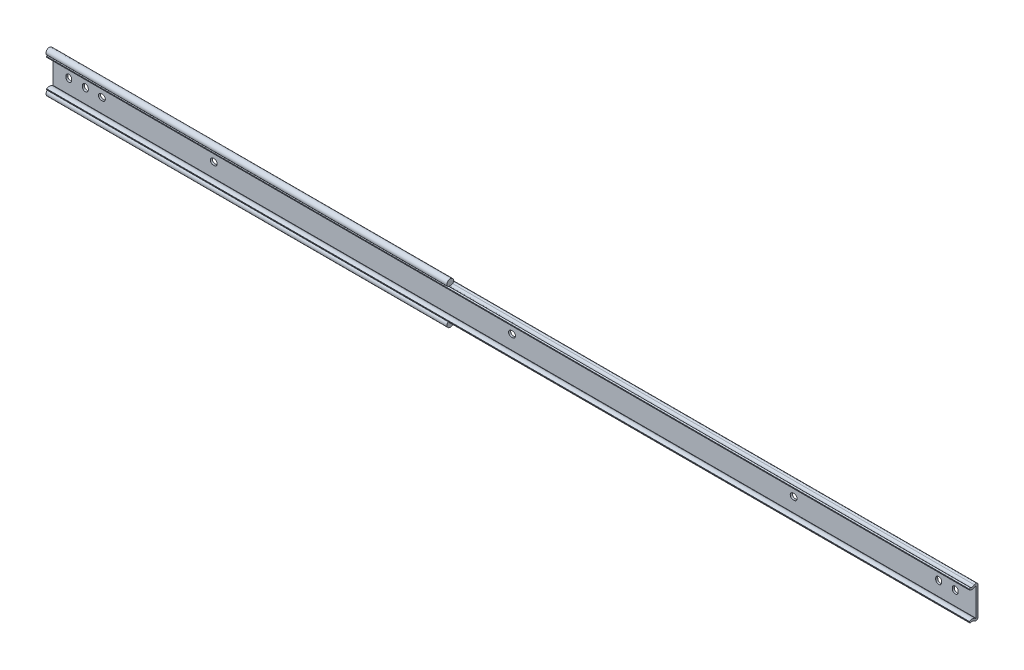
ISO-10303-21;
HEADER;
FILE_DESCRIPTION(('STEP AP214'),'2;1');
FILE_NAME('part.step','',(''),(''),'','','');
FILE_SCHEMA(('AUTOMOTIVE_DESIGN { 1 0 10303 214 1 1 1 1 }'));
ENDSEC;
DATA;
#1=APPLICATION_CONTEXT('core data for automotive mechanical design processes');
#2=APPLICATION_PROTOCOL_DEFINITION('international standard','automotive_design',2000,#1);
#3=PRODUCT_CONTEXT('',#1,'mechanical');
#4=PRODUCT('Part','Part','',(#3));
#5=PRODUCT_RELATED_PRODUCT_CATEGORY('part','',(#4));
#6=PRODUCT_DEFINITION_FORMATION('','',#4);
#7=PRODUCT_DEFINITION_CONTEXT('part definition',#1,'design');
#8=PRODUCT_DEFINITION('design','',#6,#7);
#9=PRODUCT_DEFINITION_SHAPE('','',#8);
#10=(LENGTH_UNIT() NAMED_UNIT(*) SI_UNIT(.MILLI.,.METRE.));
#11=(NAMED_UNIT(*) PLANE_ANGLE_UNIT() SI_UNIT($,.RADIAN.));
#12=(NAMED_UNIT(*) SI_UNIT($,.STERADIAN.) SOLID_ANGLE_UNIT());
#13=UNCERTAINTY_MEASURE_WITH_UNIT(LENGTH_MEASURE(1.E-05),#10,'distance_accuracy_value','');
#14=(GEOMETRIC_REPRESENTATION_CONTEXT(3) GLOBAL_UNCERTAINTY_ASSIGNED_CONTEXT((#13)) GLOBAL_UNIT_ASSIGNED_CONTEXT((#10,
#11,#12)) REPRESENTATION_CONTEXT('',''));
#15=CARTESIAN_POINT('',(0.,0.,0.));
#16=DIRECTION('',(0.,0.,1.));
#17=DIRECTION('',(1.,0.,0.));
#18=AXIS2_PLACEMENT_3D('',#15,#16,#17);
#19=CARTESIAN_POINT('',(-11.9,13.9150000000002,4.44999999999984));
#20=DIRECTION('',(1.,0.,0.));
#21=DIRECTION('',(0.,0.,-1.));
#22=AXIS2_PLACEMENT_3D('',#19,#20,#21);
#23=CYLINDRICAL_SURFACE('',#22,2.55000000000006);
#24=DIRECTION('',(1.,0.,0.));
#25=VECTOR('',#24,1.);
#26=CARTESIAN_POINT('',(-11.9,12.0059666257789,2.75941087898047));
#27=LINE('',#26,#25);
#28=CARTESIAN_POINT('',(295.4,12.0059666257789,2.75941087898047));
#29=VERTEX_POINT('',#28);
#30=CARTESIAN_POINT('',(695.3,12.0059666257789,2.75941087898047));
#31=VERTEX_POINT('',#30);
#32=EDGE_CURVE('E604',#29,#31,#27,.T.);
#33=ORIENTED_EDGE('',*,*,#32,.F.);
#34=CARTESIAN_POINT('',(295.4,13.9150000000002,4.44999999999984));
#35=DIRECTION('',(-1.,0.,0.));
#36=DIRECTION('',(0.,0.,1.));
#37=AXIS2_PLACEMENT_3D('',#34,#35,#36);
#38=CIRCLE('',#37,2.55000000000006);
#39=CARTESIAN_POINT('',(295.4,11.8784795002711,5.98462837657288));
#40=VERTEX_POINT('',#39);
#41=EDGE_CURVE('E357',#29,#40,#38,.T.);
#42=ORIENTED_EDGE('',*,*,#41,.T.);
#43=DIRECTION('',(1.,0.,0.));
#44=VECTOR('',#43,1.);
#45=CARTESIAN_POINT('',(-11.9,11.8784795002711,5.98462837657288));
#46=LINE('',#45,#44);
#47=CARTESIAN_POINT('',(695.3,11.8784795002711,5.98462837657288));
#48=VERTEX_POINT('',#47);
#49=EDGE_CURVE('E603',#40,#48,#46,.T.);
#50=ORIENTED_EDGE('',*,*,#49,.T.);
#51=CARTESIAN_POINT('',(695.3,13.9150000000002,4.44999999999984));
#52=DIRECTION('',(-1.,0.,0.));
#53=DIRECTION('',(0.,0.,1.));
#54=AXIS2_PLACEMENT_3D('',#51,#52,#53);
#55=CIRCLE('',#54,2.55000000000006);
#56=EDGE_CURVE('E531',#31,#48,#55,.T.);
#57=ORIENTED_EDGE('',*,*,#56,.F.);
#58=EDGE_LOOP('',(#33,#42,#50,#57));
#59=FACE_BOUND('',#58,.T.);
#60=ADVANCED_FACE('F14',(#59),#23,.F.);
#61=CARTESIAN_POINT('',(-11.9,-10.7622239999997,0.));
#62=DIRECTION('',(0.,0.,-1.));
#63=DIRECTION('',(-1.,0.,0.));
#64=AXIS2_PLACEMENT_3D('',#61,#62,#63);
#65=PLANE('',#64);
#66=DIRECTION('',(0.,1.,0.));
#67=VECTOR('',#66,1.);
#68=CARTESIAN_POINT('',(-11.9,-10.7622239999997,0.));
#69=LINE('',#68,#67);
#70=CARTESIAN_POINT('',(-11.9,-10.7622239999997,0.));
#71=VERTEX_POINT('',#70);
#72=CARTESIAN_POINT('',(-11.9,10.7622240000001,0.));
#73=VERTEX_POINT('',#72);
#74=EDGE_CURVE('E599',#71,#73,#69,.T.);
#75=ORIENTED_EDGE('',*,*,#74,.T.);
#76=DIRECTION('',(1.,0.,0.));
#77=VECTOR('',#76,1.);
#78=CARTESIAN_POINT('',(-11.9,10.7622240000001,0.));
#79=LINE('',#78,#77);
#80=CARTESIAN_POINT('',(695.3,10.7622240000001,0.));
#81=VERTEX_POINT('',#80);
#82=EDGE_CURVE('E607',#73,#81,#79,.T.);
#83=ORIENTED_EDGE('',*,*,#82,.T.);
#84=DIRECTION('',(0.,1.,0.));
#85=VECTOR('',#84,1.);
#86=CARTESIAN_POINT('',(695.3,-10.7622239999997,0.));
#87=LINE('',#86,#85);
#88=CARTESIAN_POINT('',(695.3,-10.7622239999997,0.));
#89=VERTEX_POINT('',#88);
#90=EDGE_CURVE('E572',#89,#81,#87,.T.);
#91=ORIENTED_EDGE('',*,*,#90,.F.);
#92=DIRECTION('',(1.,0.,0.));
#93=VECTOR('',#92,1.);
#94=CARTESIAN_POINT('',(-11.9,-10.7622239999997,0.));
#95=LINE('',#94,#93);
#96=EDGE_CURVE('E609',#71,#89,#95,.T.);
#97=ORIENTED_EDGE('',*,*,#96,.F.);
#98=EDGE_LOOP('',(#75,#83,#91,#97));
#99=FACE_BOUND('',#98,.T.);
#100=CARTESIAN_POINT('',(556.,0.00222400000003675,0.));
#101=DIRECTION('',(0.,0.,-1.));
#102=DIRECTION('',(-1.,0.,0.));
#103=AXIS2_PLACEMENT_3D('',#100,#101,#102);
#104=CIRCLE('',#103,2.25);
#105=CARTESIAN_POINT('',(556.,2.25222400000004,0.));
#106=VERTEX_POINT('',#105);
#107=CARTESIAN_POINT('',(556.,-2.24777599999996,0.));
#108=VERTEX_POINT('',#107);
#109=EDGE_CURVE('E374',#106,#108,#104,.T.);
#110=ORIENTED_EDGE('',*,*,#109,.F.);
#111=DIRECTION('',(1.,0.,0.));
#112=VECTOR('',#111,1.);
#113=CARTESIAN_POINT('',(555.2,2.25222400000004,0.));
#114=LINE('',#113,#112);
#115=CARTESIAN_POINT('',(555.2,2.25222400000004,0.));
#116=VERTEX_POINT('',#115);
#117=EDGE_CURVE('E382',#116,#106,#114,.T.);
#118=ORIENTED_EDGE('',*,*,#117,.F.);
#119=CARTESIAN_POINT('',(555.2,0.00222400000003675,0.));
#120=DIRECTION('',(0.,0.,-1.));
#121=DIRECTION('',(-1.,0.,0.));
#122=AXIS2_PLACEMENT_3D('',#119,#120,#121);
#123=CIRCLE('',#122,2.25);
#124=CARTESIAN_POINT('',(555.2,-2.24777599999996,0.));
#125=VERTEX_POINT('',#124);
#126=EDGE_CURVE('E379',#125,#116,#123,.T.);
#127=ORIENTED_EDGE('',*,*,#126,.F.);
#128=DIRECTION('',(-1.,0.,0.));
#129=VECTOR('',#128,1.);
#130=CARTESIAN_POINT('',(556.,-2.24777599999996,0.));
#131=LINE('',#130,#129);
#132=EDGE_CURVE('E376',#108,#125,#131,.T.);
#133=ORIENTED_EDGE('',*,*,#132,.F.);
#134=EDGE_LOOP('',(#110,#118,#127,#133));
#135=FACE_BOUND('',#134,.T.);
#136=CARTESIAN_POINT('',(110.700000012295,0.00373824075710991,0.));
#137=DIRECTION('',(0.,0.,-1.));
#138=DIRECTION('',(-1.,0.,0.));
#139=AXIS2_PLACEMENT_3D('',#136,#137,#138);
#140=CIRCLE('',#139,2.25);
#141=CARTESIAN_POINT('',(110.700000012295,-2.24626175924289,0.));
#142=VERTEX_POINT('',#141);
#143=CARTESIAN_POINT('',(110.700000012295,2.25373824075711,0.));
#144=VERTEX_POINT('',#143);
#145=EDGE_CURVE('E397',#142,#144,#140,.T.);
#146=ORIENTED_EDGE('',*,*,#145,.F.);
#147=DIRECTION('',(-1.,0.,0.));
#148=VECTOR('',#147,1.);
#149=CARTESIAN_POINT('',(111.500000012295,-2.24626175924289,0.));
#150=LINE('',#149,#148);
#151=CARTESIAN_POINT('',(111.500000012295,-2.24626175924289,0.));
#152=VERTEX_POINT('',#151);
#153=EDGE_CURVE('E405',#152,#142,#150,.T.);
#154=ORIENTED_EDGE('',*,*,#153,.F.);
#155=CARTESIAN_POINT('',(111.500000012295,0.00373824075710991,0.));
#156=DIRECTION('',(0.,0.,-1.));
#157=DIRECTION('',(-1.,0.,0.));
#158=AXIS2_PLACEMENT_3D('',#155,#156,#157);
#159=CIRCLE('',#158,2.25);
#160=CARTESIAN_POINT('',(111.500000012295,2.25373824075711,0.));
#161=VERTEX_POINT('',#160);
#162=EDGE_CURVE('E402',#161,#152,#159,.T.);
#163=ORIENTED_EDGE('',*,*,#162,.F.);
#164=DIRECTION('',(1.,0.,0.));
#165=VECTOR('',#164,1.);
#166=CARTESIAN_POINT('',(110.700000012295,2.25373824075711,0.));
#167=LINE('',#166,#165);
#168=EDGE_CURVE('E399',#144,#161,#167,.T.);
#169=ORIENTED_EDGE('',*,*,#168,.F.);
#170=EDGE_LOOP('',(#146,#154,#163,#169));
#171=FACE_BOUND('',#170,.T.);
#172=CARTESIAN_POINT('',(339.30000000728,0.00222400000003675,0.));
#173=DIRECTION('',(0.,0.,-1.));
#174=DIRECTION('',(-1.,0.,0.));
#175=AXIS2_PLACEMENT_3D('',#172,#173,#174);
#176=CIRCLE('',#175,2.25);
#177=CARTESIAN_POINT('',(339.30000000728,-2.24777599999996,0.));
#178=VERTEX_POINT('',#177);
#179=CARTESIAN_POINT('',(339.30000000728,2.25222400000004,0.));
#180=VERTEX_POINT('',#179);
#181=EDGE_CURVE('E411',#178,#180,#176,.T.);
#182=ORIENTED_EDGE('',*,*,#181,.F.);
#183=DIRECTION('',(-1.,0.,0.));
#184=VECTOR('',#183,1.);
#185=CARTESIAN_POINT('',(340.10000000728,-2.24777599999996,0.));
#186=LINE('',#185,#184);
#187=CARTESIAN_POINT('',(340.10000000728,-2.24777599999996,0.));
#188=VERTEX_POINT('',#187);
#189=EDGE_CURVE('E425',#188,#178,#186,.T.);
#190=ORIENTED_EDGE('',*,*,#189,.F.);
#191=CARTESIAN_POINT('',(340.10000000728,0.00222400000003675,0.));
#192=DIRECTION('',(0.,0.,-1.));
#193=DIRECTION('',(-1.,0.,0.));
#194=AXIS2_PLACEMENT_3D('',#191,#192,#193);
#195=CIRCLE('',#194,2.25);
#196=CARTESIAN_POINT('',(340.10000000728,2.25222400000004,0.));
#197=VERTEX_POINT('',#196);
#198=EDGE_CURVE('E422',#197,#188,#195,.T.);
#199=ORIENTED_EDGE('',*,*,#198,.F.);
#200=DIRECTION('',(1.,0.,0.));
#201=VECTOR('',#200,1.);
#202=CARTESIAN_POINT('',(339.30000000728,2.25222400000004,0.));
#203=LINE('',#202,#201);
#204=EDGE_CURVE('E419',#180,#197,#203,.T.);
#205=ORIENTED_EDGE('',*,*,#204,.F.);
#206=EDGE_LOOP('',(#182,#190,#199,#205));
#207=FACE_BOUND('',#206,.T.);
#208=CARTESIAN_POINT('',(25.000000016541,0.00465141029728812,0.));
#209=DIRECTION('',(0.,0.,-1.));
#210=DIRECTION('',(-1.,0.,0.));
#211=AXIS2_PLACEMENT_3D('',#208,#209,#210);
#212=CIRCLE('',#211,2.25);
#213=CARTESIAN_POINT('',(25.000000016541,-2.24534858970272,0.));
#214=VERTEX_POINT('',#213);
#215=CARTESIAN_POINT('',(25.000000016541,2.25465141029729,0.));
#216=VERTEX_POINT('',#215);
#217=EDGE_CURVE('E431',#214,#216,#212,.T.);
#218=ORIENTED_EDGE('',*,*,#217,.F.);
#219=DIRECTION('',(-1.,0.,0.));
#220=VECTOR('',#219,1.);
#221=CARTESIAN_POINT('',(25.800000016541,-2.24534858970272,0.));
#222=LINE('',#221,#220);
#223=CARTESIAN_POINT('',(25.800000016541,-2.24534858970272,0.));
#224=VERTEX_POINT('',#223);
#225=EDGE_CURVE('E445',#224,#214,#222,.T.);
#226=ORIENTED_EDGE('',*,*,#225,.F.);
#227=CARTESIAN_POINT('',(25.800000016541,0.00465141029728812,0.));
#228=DIRECTION('',(0.,0.,-1.));
#229=DIRECTION('',(-1.,0.,0.));
#230=AXIS2_PLACEMENT_3D('',#227,#228,#229);
#231=CIRCLE('',#230,2.25);
#232=CARTESIAN_POINT('',(25.800000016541,2.25465141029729,0.));
#233=VERTEX_POINT('',#232);
#234=EDGE_CURVE('E442',#233,#224,#231,.T.);
#235=ORIENTED_EDGE('',*,*,#234,.F.);
#236=DIRECTION('',(1.,0.,0.));
#237=VECTOR('',#236,1.);
#238=CARTESIAN_POINT('',(25.000000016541,2.25465141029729,0.));
#239=LINE('',#238,#237);
#240=EDGE_CURVE('E439',#216,#233,#239,.T.);
#241=ORIENTED_EDGE('',*,*,#240,.F.);
#242=EDGE_LOOP('',(#218,#226,#235,#241));
#243=FACE_BOUND('',#242,.T.);
#244=CARTESIAN_POINT('',(0.,-0.400000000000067,0.));
#245=DIRECTION('',(0.,0.,-1.));
#246=DIRECTION('',(1.,0.,0.));
#247=AXIS2_PLACEMENT_3D('',#244,#245,#246);
#248=CIRCLE('',#247,2.24999999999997);
#249=CARTESIAN_POINT('',(2.24999999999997,-0.400000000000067,0.));
#250=VERTEX_POINT('',#249);
#251=CARTESIAN_POINT('',(-2.24999999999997,-0.400000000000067,0.));
#252=VERTEX_POINT('',#251);
#253=EDGE_CURVE('E451',#250,#252,#248,.T.);
#254=ORIENTED_EDGE('',*,*,#253,.F.);
#255=DIRECTION('',(0.,-1.,0.));
#256=VECTOR('',#255,1.);
#257=CARTESIAN_POINT('',(2.24999999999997,-0.400000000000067,0.));
#258=LINE('',#257,#256);
#259=CARTESIAN_POINT('',(2.24999999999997,0.400000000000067,0.));
#260=VERTEX_POINT('',#259);
#261=EDGE_CURVE('E465',#260,#250,#258,.T.);
#262=ORIENTED_EDGE('',*,*,#261,.F.);
#263=CARTESIAN_POINT('',(0.,0.400000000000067,0.));
#264=DIRECTION('',(0.,0.,-1.));
#265=DIRECTION('',(1.,0.,0.));
#266=AXIS2_PLACEMENT_3D('',#263,#264,#265);
#267=CIRCLE('',#266,2.24999999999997);
#268=CARTESIAN_POINT('',(-2.24999999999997,0.400000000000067,0.));
#269=VERTEX_POINT('',#268);
#270=EDGE_CURVE('E462',#269,#260,#267,.T.);
#271=ORIENTED_EDGE('',*,*,#270,.F.);
#272=DIRECTION('',(0.,1.,0.));
#273=VECTOR('',#272,1.);
#274=CARTESIAN_POINT('',(-2.24999999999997,-0.400000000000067,0.));
#275=LINE('',#274,#273);
#276=EDGE_CURVE('E459',#252,#269,#275,.T.);
#277=ORIENTED_EDGE('',*,*,#276,.F.);
#278=EDGE_LOOP('',(#254,#262,#271,#277));
#279=FACE_BOUND('',#278,.T.);
#280=CARTESIAN_POINT('',(12.7,-0.400000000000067,0.));
#281=DIRECTION('',(0.,0.,-1.));
#282=DIRECTION('',(1.,0.,0.));
#283=AXIS2_PLACEMENT_3D('',#280,#281,#282);
#284=CIRCLE('',#283,2.24999999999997);
#285=CARTESIAN_POINT('',(14.95,-0.400000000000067,0.));
#286=VERTEX_POINT('',#285);
#287=CARTESIAN_POINT('',(10.45,-0.400000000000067,0.));
#288=VERTEX_POINT('',#287);
#289=EDGE_CURVE('E471',#286,#288,#284,.T.);
#290=ORIENTED_EDGE('',*,*,#289,.F.);
#291=DIRECTION('',(0.,-1.,0.));
#292=VECTOR('',#291,1.);
#293=CARTESIAN_POINT('',(14.95,-0.400000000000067,0.));
#294=LINE('',#293,#292);
#295=CARTESIAN_POINT('',(14.95,0.400000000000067,0.));
#296=VERTEX_POINT('',#295);
#297=EDGE_CURVE('E485',#296,#286,#294,.T.);
#298=ORIENTED_EDGE('',*,*,#297,.F.);
#299=CARTESIAN_POINT('',(12.7,0.400000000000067,0.));
#300=DIRECTION('',(0.,0.,-1.));
#301=DIRECTION('',(1.,0.,0.));
#302=AXIS2_PLACEMENT_3D('',#299,#300,#301);
#303=CIRCLE('',#302,2.24999999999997);
#304=CARTESIAN_POINT('',(10.45,0.400000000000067,0.));
#305=VERTEX_POINT('',#304);
#306=EDGE_CURVE('E482',#305,#296,#303,.T.);
#307=ORIENTED_EDGE('',*,*,#306,.F.);
#308=DIRECTION('',(0.,1.,0.));
#309=VECTOR('',#308,1.);
#310=CARTESIAN_POINT('',(10.45,-0.400000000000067,0.));
#311=LINE('',#310,#309);
#312=EDGE_CURVE('E479',#288,#305,#311,.T.);
#313=ORIENTED_EDGE('',*,*,#312,.F.);
#314=EDGE_LOOP('',(#290,#298,#307,#313));
#315=FACE_BOUND('',#314,.T.);
#316=CARTESIAN_POINT('',(666.7,-0.400000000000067,0.));
#317=DIRECTION('',(0.,0.,-1.));
#318=DIRECTION('',(1.,0.,0.));
#319=AXIS2_PLACEMENT_3D('',#316,#317,#318);
#320=CIRCLE('',#319,2.24999999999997);
#321=CARTESIAN_POINT('',(668.95,-0.400000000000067,0.));
#322=VERTEX_POINT('',#321);
#323=CARTESIAN_POINT('',(664.45,-0.400000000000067,0.));
#324=VERTEX_POINT('',#323);
#325=EDGE_CURVE('E491',#322,#324,#320,.T.);
#326=ORIENTED_EDGE('',*,*,#325,.F.);
#327=DIRECTION('',(0.,-1.,0.));
#328=VECTOR('',#327,1.);
#329=CARTESIAN_POINT('',(668.95,-0.400000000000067,0.));
#330=LINE('',#329,#328);
#331=CARTESIAN_POINT('',(668.95,0.400000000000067,0.));
#332=VERTEX_POINT('',#331);
#333=EDGE_CURVE('E505',#332,#322,#330,.T.);
#334=ORIENTED_EDGE('',*,*,#333,.F.);
#335=CARTESIAN_POINT('',(666.7,0.400000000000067,0.));
#336=DIRECTION('',(0.,0.,-1.));
#337=DIRECTION('',(1.,0.,0.));
#338=AXIS2_PLACEMENT_3D('',#335,#336,#337);
#339=CIRCLE('',#338,2.24999999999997);
#340=CARTESIAN_POINT('',(664.45,0.400000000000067,0.));
#341=VERTEX_POINT('',#340);
#342=EDGE_CURVE('E502',#341,#332,#339,.T.);
#343=ORIENTED_EDGE('',*,*,#342,.F.);
#344=DIRECTION('',(0.,1.,0.));
#345=VECTOR('',#344,1.);
#346=CARTESIAN_POINT('',(664.45,-0.400000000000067,0.));
#347=LINE('',#346,#345);
#348=EDGE_CURVE('E499',#324,#341,#347,.T.);
#349=ORIENTED_EDGE('',*,*,#348,.F.);
#350=EDGE_LOOP('',(#326,#334,#343,#349));
#351=FACE_BOUND('',#350,.T.);
#352=CARTESIAN_POINT('',(679.4,-0.400000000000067,0.));
#353=DIRECTION('',(0.,0.,-1.));
#354=DIRECTION('',(1.,0.,0.));
#355=AXIS2_PLACEMENT_3D('',#352,#353,#354);
#356=CIRCLE('',#355,2.24999999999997);
#357=CARTESIAN_POINT('',(681.65,-0.400000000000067,0.));
#358=VERTEX_POINT('',#357);
#359=CARTESIAN_POINT('',(677.15,-0.400000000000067,0.));
#360=VERTEX_POINT('',#359);
#361=EDGE_CURVE('E511',#358,#360,#356,.T.);
#362=ORIENTED_EDGE('',*,*,#361,.F.);
#363=DIRECTION('',(0.,-1.,0.));
#364=VECTOR('',#363,1.);
#365=CARTESIAN_POINT('',(681.65,-0.400000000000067,0.));
#366=LINE('',#365,#364);
#367=CARTESIAN_POINT('',(681.65,0.400000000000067,0.));
#368=VERTEX_POINT('',#367);
#369=EDGE_CURVE('E525',#368,#358,#366,.T.);
#370=ORIENTED_EDGE('',*,*,#369,.F.);
#371=CARTESIAN_POINT('',(679.4,0.400000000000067,0.));
#372=DIRECTION('',(0.,0.,-1.));
#373=DIRECTION('',(1.,0.,0.));
#374=AXIS2_PLACEMENT_3D('',#371,#372,#373);
#375=CIRCLE('',#374,2.24999999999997);
#376=CARTESIAN_POINT('',(677.15,0.400000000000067,0.));
#377=VERTEX_POINT('',#376);
#378=EDGE_CURVE('E522',#377,#368,#375,.T.);
#379=ORIENTED_EDGE('',*,*,#378,.F.);
#380=DIRECTION('',(0.,1.,0.));
#381=VECTOR('',#380,1.);
#382=CARTESIAN_POINT('',(677.15,-0.400000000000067,0.));
#383=LINE('',#382,#381);
#384=EDGE_CURVE('E519',#360,#377,#383,.T.);
#385=ORIENTED_EDGE('',*,*,#384,.F.);
#386=EDGE_LOOP('',(#362,#370,#379,#385));
#387=FACE_BOUND('',#386,.T.);
#388=ADVANCED_FACE('F722',(#99,#135,#171,#207,#243,#279,#315,#351,#387),#65,.T.);
#389=CARTESIAN_POINT('',(-11.9,10.7622240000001,1.54999999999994));
#390=DIRECTION('',(0.,0.,1.));
#391=DIRECTION('',(1.,0.,0.));
#392=AXIS2_PLACEMENT_3D('',#389,#390,#391);
#393=PLANE('',#392);
#394=DIRECTION('',(0.,-1.,0.));
#395=VECTOR('',#394,1.);
#396=CARTESIAN_POINT('',(-11.9,10.7622240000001,1.54999999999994));
#397=LINE('',#396,#395);
#398=CARTESIAN_POINT('',(-11.9,10.7622240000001,1.54999999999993));
#399=VERTEX_POINT('',#398);
#400=CARTESIAN_POINT('',(-11.9,-10.7622239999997,1.54999999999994));
#401=VERTEX_POINT('',#400);
#402=EDGE_CURVE('E584',#399,#401,#397,.T.);
#403=ORIENTED_EDGE('',*,*,#402,.T.);
#404=DIRECTION('',(1.,0.,0.));
#405=VECTOR('',#404,1.);
#406=CARTESIAN_POINT('',(-11.9,-10.7622239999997,1.54999999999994));
#407=LINE('',#406,#405);
#408=CARTESIAN_POINT('',(695.3,-10.7622239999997,1.54999999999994));
#409=VERTEX_POINT('',#408);
#410=EDGE_CURVE('E622',#401,#409,#407,.T.);
#411=ORIENTED_EDGE('',*,*,#410,.T.);
#412=DIRECTION('',(0.,-1.,0.));
#413=VECTOR('',#412,1.);
#414=CARTESIAN_POINT('',(695.3,10.7622240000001,1.54999999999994));
#415=LINE('',#414,#413);
#416=CARTESIAN_POINT('',(695.3,10.7622240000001,1.54999999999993));
#417=VERTEX_POINT('',#416);
#418=EDGE_CURVE('E552',#417,#409,#415,.T.);
#419=ORIENTED_EDGE('',*,*,#418,.F.);
#420=DIRECTION('',(1.,0.,0.));
#421=VECTOR('',#420,1.);
#422=CARTESIAN_POINT('',(-11.9,10.7622240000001,1.54999999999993));
#423=LINE('',#422,#421);
#424=EDGE_CURVE('E624',#399,#417,#423,.T.);
#425=ORIENTED_EDGE('',*,*,#424,.F.);
#426=EDGE_LOOP('',(#403,#411,#419,#425));
#427=FACE_BOUND('',#426,.T.);
#428=CARTESIAN_POINT('',(556.,0.00222400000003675,1.54999999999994));
#429=DIRECTION('',(0.,0.,1.));
#430=DIRECTION('',(1.,0.,0.));
#431=AXIS2_PLACEMENT_3D('',#428,#429,#430);
#432=CIRCLE('',#431,2.25);
#433=CARTESIAN_POINT('',(556.,2.25222400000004,1.54999999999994));
#434=VERTEX_POINT('',#433);
#435=CARTESIAN_POINT('',(556.,-2.24777599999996,1.54999999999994));
#436=VERTEX_POINT('',#435);
#437=EDGE_CURVE('E371',#434,#436,#432,.F.);
#438=ORIENTED_EDGE('',*,*,#437,.T.);
#439=DIRECTION('',(-1.,0.,0.));
#440=VECTOR('',#439,1.);
#441=CARTESIAN_POINT('',(556.,-2.24777599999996,1.54999999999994));
#442=LINE('',#441,#440);
#443=CARTESIAN_POINT('',(555.2,-2.24777599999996,1.54999999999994));
#444=VERTEX_POINT('',#443);
#445=EDGE_CURVE('E388',#436,#444,#442,.T.);
#446=ORIENTED_EDGE('',*,*,#445,.T.);
#447=CARTESIAN_POINT('',(555.2,0.00222400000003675,1.54999999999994));
#448=DIRECTION('',(0.,0.,1.));
#449=DIRECTION('',(1.,0.,0.));
#450=AXIS2_PLACEMENT_3D('',#447,#448,#449);
#451=CIRCLE('',#450,2.25);
#452=CARTESIAN_POINT('',(555.2,2.25222400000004,1.54999999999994));
#453=VERTEX_POINT('',#452);
#454=EDGE_CURVE('E365',#444,#453,#451,.F.);
#455=ORIENTED_EDGE('',*,*,#454,.T.);
#456=DIRECTION('',(1.,0.,0.));
#457=VECTOR('',#456,1.);
#458=CARTESIAN_POINT('',(555.2,2.25222400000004,1.54999999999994));
#459=LINE('',#458,#457);
#460=EDGE_CURVE('E368',#453,#434,#459,.T.);
#461=ORIENTED_EDGE('',*,*,#460,.T.);
#462=EDGE_LOOP('',(#438,#446,#455,#461));
#463=FACE_BOUND('',#462,.T.);
#464=CARTESIAN_POINT('',(110.700000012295,0.00373824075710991,1.54999999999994));
#465=DIRECTION('',(0.,0.,1.));
#466=DIRECTION('',(1.,0.,0.));
#467=AXIS2_PLACEMENT_3D('',#464,#465,#466);
#468=CIRCLE('',#467,2.25);
#469=CARTESIAN_POINT('',(110.700000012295,2.25373824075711,1.54999999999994));
#470=VERTEX_POINT('',#469);
#471=CARTESIAN_POINT('',(110.700000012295,-2.24626175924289,1.54999999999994));
#472=VERTEX_POINT('',#471);
#473=EDGE_CURVE('E693',#470,#472,#468,.T.);
#474=ORIENTED_EDGE('',*,*,#473,.F.);
#475=DIRECTION('',(-1.,0.,0.));
#476=VECTOR('',#475,1.);
#477=CARTESIAN_POINT('',(-11.9,2.25373824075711,1.54999999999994));
#478=LINE('',#477,#476);
#479=CARTESIAN_POINT('',(111.500000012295,2.25373824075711,1.54999999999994));
#480=VERTEX_POINT('',#479);
#481=EDGE_CURVE('E686',#480,#470,#478,.T.);
#482=ORIENTED_EDGE('',*,*,#481,.F.);
#483=CARTESIAN_POINT('',(111.500000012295,0.00373824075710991,1.54999999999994));
#484=DIRECTION('',(0.,0.,1.));
#485=DIRECTION('',(1.,0.,0.));
#486=AXIS2_PLACEMENT_3D('',#483,#484,#485);
#487=CIRCLE('',#486,2.25);
#488=CARTESIAN_POINT('',(111.500000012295,-2.24626175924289,1.54999999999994));
#489=VERTEX_POINT('',#488);
#490=EDGE_CURVE('E688',#489,#480,#487,.T.);
#491=ORIENTED_EDGE('',*,*,#490,.F.);
#492=DIRECTION('',(1.,0.,0.));
#493=VECTOR('',#492,1.);
#494=CARTESIAN_POINT('',(-11.9,-2.24626175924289,1.54999999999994));
#495=LINE('',#494,#493);
#496=EDGE_CURVE('E691',#472,#489,#495,.T.);
#497=ORIENTED_EDGE('',*,*,#496,.F.);
#498=EDGE_LOOP('',(#474,#482,#491,#497));
#499=FACE_BOUND('',#498,.T.);
#500=CARTESIAN_POINT('',(339.30000000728,0.00222400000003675,1.54999999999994));
#501=DIRECTION('',(0.,0.,1.));
#502=DIRECTION('',(1.,0.,0.));
#503=AXIS2_PLACEMENT_3D('',#500,#501,#502);
#504=CIRCLE('',#503,2.25);
#505=CARTESIAN_POINT('',(339.30000000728,2.25222400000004,1.54999999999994));
#506=VERTEX_POINT('',#505);
#507=CARTESIAN_POINT('',(339.30000000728,-2.24777599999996,1.54999999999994));
#508=VERTEX_POINT('',#507);
#509=EDGE_CURVE('E684',#506,#508,#504,.T.);
#510=ORIENTED_EDGE('',*,*,#509,.F.);
#511=DIRECTION('',(-1.,0.,0.));
#512=VECTOR('',#511,1.);
#513=CARTESIAN_POINT('',(-11.9,2.25222400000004,1.54999999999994));
#514=LINE('',#513,#512);
#515=CARTESIAN_POINT('',(340.10000000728,2.25222400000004,1.54999999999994));
#516=VERTEX_POINT('',#515);
#517=EDGE_CURVE('E677',#516,#506,#514,.T.);
#518=ORIENTED_EDGE('',*,*,#517,.F.);
#519=CARTESIAN_POINT('',(340.10000000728,0.00222400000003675,1.54999999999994));
#520=DIRECTION('',(0.,0.,1.));
#521=DIRECTION('',(1.,0.,0.));
#522=AXIS2_PLACEMENT_3D('',#519,#520,#521);
#523=CIRCLE('',#522,2.25);
#524=CARTESIAN_POINT('',(340.10000000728,-2.24777599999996,1.54999999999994));
#525=VERTEX_POINT('',#524);
#526=EDGE_CURVE('E679',#525,#516,#523,.T.);
#527=ORIENTED_EDGE('',*,*,#526,.F.);
#528=DIRECTION('',(1.,0.,0.));
#529=VECTOR('',#528,1.);
#530=CARTESIAN_POINT('',(-11.9,-2.24777599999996,1.54999999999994));
#531=LINE('',#530,#529);
#532=EDGE_CURVE('E682',#508,#525,#531,.T.);
#533=ORIENTED_EDGE('',*,*,#532,.F.);
#534=EDGE_LOOP('',(#510,#518,#527,#533));
#535=FACE_BOUND('',#534,.T.);
#536=CARTESIAN_POINT('',(25.000000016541,0.00465141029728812,1.54999999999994));
#537=DIRECTION('',(0.,0.,1.));
#538=DIRECTION('',(1.,0.,0.));
#539=AXIS2_PLACEMENT_3D('',#536,#537,#538);
#540=CIRCLE('',#539,2.25);
#541=CARTESIAN_POINT('',(25.000000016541,2.25465141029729,1.54999999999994));
#542=VERTEX_POINT('',#541);
#543=CARTESIAN_POINT('',(25.000000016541,-2.24534858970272,1.54999999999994));
#544=VERTEX_POINT('',#543);
#545=EDGE_CURVE('E675',#542,#544,#540,.T.);
#546=ORIENTED_EDGE('',*,*,#545,.F.);
#547=DIRECTION('',(-1.,0.,0.));
#548=VECTOR('',#547,1.);
#549=CARTESIAN_POINT('',(-11.9,2.25465141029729,1.54999999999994));
#550=LINE('',#549,#548);
#551=CARTESIAN_POINT('',(25.800000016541,2.25465141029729,1.54999999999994));
#552=VERTEX_POINT('',#551);
#553=EDGE_CURVE('E668',#552,#542,#550,.T.);
#554=ORIENTED_EDGE('',*,*,#553,.F.);
#555=CARTESIAN_POINT('',(25.800000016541,0.00465141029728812,1.54999999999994));
#556=DIRECTION('',(0.,0.,1.));
#557=DIRECTION('',(1.,0.,0.));
#558=AXIS2_PLACEMENT_3D('',#555,#556,#557);
#559=CIRCLE('',#558,2.25);
#560=CARTESIAN_POINT('',(25.800000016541,-2.24534858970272,1.54999999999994));
#561=VERTEX_POINT('',#560);
#562=EDGE_CURVE('E670',#561,#552,#559,.T.);
#563=ORIENTED_EDGE('',*,*,#562,.F.);
#564=DIRECTION('',(1.,0.,0.));
#565=VECTOR('',#564,1.);
#566=CARTESIAN_POINT('',(-11.9,-2.24534858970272,1.54999999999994));
#567=LINE('',#566,#565);
#568=EDGE_CURVE('E673',#544,#561,#567,.T.);
#569=ORIENTED_EDGE('',*,*,#568,.F.);
#570=EDGE_LOOP('',(#546,#554,#563,#569));
#571=FACE_BOUND('',#570,.T.);
#572=CARTESIAN_POINT('',(0.,-0.400000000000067,1.54999999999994));
#573=DIRECTION('',(0.,0.,1.));
#574=DIRECTION('',(1.,0.,0.));
#575=AXIS2_PLACEMENT_3D('',#572,#573,#574);
#576=CIRCLE('',#575,2.24999999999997);
#577=CARTESIAN_POINT('',(-2.24999999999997,-0.400000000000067,1.54999999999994));
#578=VERTEX_POINT('',#577);
#579=CARTESIAN_POINT('',(2.24999999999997,-0.400000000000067,1.54999999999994));
#580=VERTEX_POINT('',#579);
#581=EDGE_CURVE('E666',#578,#580,#576,.T.);
#582=ORIENTED_EDGE('',*,*,#581,.F.);
#583=DIRECTION('',(0.,-1.,0.));
#584=VECTOR('',#583,1.);
#585=CARTESIAN_POINT('',(-2.24999999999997,10.7622240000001,1.54999999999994));
#586=LINE('',#585,#584);
#587=CARTESIAN_POINT('',(-2.24999999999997,0.400000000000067,1.54999999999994));
#588=VERTEX_POINT('',#587);
#589=EDGE_CURVE('E659',#588,#578,#586,.T.);
#590=ORIENTED_EDGE('',*,*,#589,.F.);
#591=CARTESIAN_POINT('',(0.,0.400000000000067,1.54999999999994));
#592=DIRECTION('',(0.,0.,1.));
#593=DIRECTION('',(1.,0.,0.));
#594=AXIS2_PLACEMENT_3D('',#591,#592,#593);
#595=CIRCLE('',#594,2.24999999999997);
#596=CARTESIAN_POINT('',(2.24999999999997,0.400000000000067,1.54999999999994));
#597=VERTEX_POINT('',#596);
#598=EDGE_CURVE('E661',#597,#588,#595,.T.);
#599=ORIENTED_EDGE('',*,*,#598,.F.);
#600=DIRECTION('',(0.,1.,0.));
#601=VECTOR('',#600,1.);
#602=CARTESIAN_POINT('',(2.24999999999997,10.7622240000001,1.54999999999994));
#603=LINE('',#602,#601);
#604=EDGE_CURVE('E664',#580,#597,#603,.T.);
#605=ORIENTED_EDGE('',*,*,#604,.F.);
#606=EDGE_LOOP('',(#582,#590,#599,#605));
#607=FACE_BOUND('',#606,.T.);
#608=CARTESIAN_POINT('',(12.7,-0.400000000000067,1.54999999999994));
#609=DIRECTION('',(0.,0.,1.));
#610=DIRECTION('',(1.,0.,0.));
#611=AXIS2_PLACEMENT_3D('',#608,#609,#610);
#612=CIRCLE('',#611,2.24999999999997);
#613=CARTESIAN_POINT('',(10.45,-0.400000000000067,1.54999999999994));
#614=VERTEX_POINT('',#613);
#615=CARTESIAN_POINT('',(14.95,-0.400000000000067,1.54999999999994));
#616=VERTEX_POINT('',#615);
#617=EDGE_CURVE('E657',#614,#616,#612,.T.);
#618=ORIENTED_EDGE('',*,*,#617,.F.);
#619=DIRECTION('',(0.,-1.,0.));
#620=VECTOR('',#619,1.);
#621=CARTESIAN_POINT('',(10.45,10.7622240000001,1.54999999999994));
#622=LINE('',#621,#620);
#623=CARTESIAN_POINT('',(10.45,0.400000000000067,1.54999999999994));
#624=VERTEX_POINT('',#623);
#625=EDGE_CURVE('E650',#624,#614,#622,.T.);
#626=ORIENTED_EDGE('',*,*,#625,.F.);
#627=CARTESIAN_POINT('',(12.7,0.400000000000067,1.54999999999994));
#628=DIRECTION('',(0.,0.,1.));
#629=DIRECTION('',(1.,0.,0.));
#630=AXIS2_PLACEMENT_3D('',#627,#628,#629);
#631=CIRCLE('',#630,2.24999999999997);
#632=CARTESIAN_POINT('',(14.95,0.400000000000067,1.54999999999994));
#633=VERTEX_POINT('',#632);
#634=EDGE_CURVE('E652',#633,#624,#631,.T.);
#635=ORIENTED_EDGE('',*,*,#634,.F.);
#636=DIRECTION('',(0.,1.,0.));
#637=VECTOR('',#636,1.);
#638=CARTESIAN_POINT('',(14.95,10.7622240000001,1.54999999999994));
#639=LINE('',#638,#637);
#640=EDGE_CURVE('E655',#616,#633,#639,.T.);
#641=ORIENTED_EDGE('',*,*,#640,.F.);
#642=EDGE_LOOP('',(#618,#626,#635,#641));
#643=FACE_BOUND('',#642,.T.);
#644=CARTESIAN_POINT('',(666.7,-0.400000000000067,1.54999999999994));
#645=DIRECTION('',(0.,0.,1.));
#646=DIRECTION('',(1.,0.,0.));
#647=AXIS2_PLACEMENT_3D('',#644,#645,#646);
#648=CIRCLE('',#647,2.24999999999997);
#649=CARTESIAN_POINT('',(664.45,-0.400000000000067,1.54999999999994));
#650=VERTEX_POINT('',#649);
#651=CARTESIAN_POINT('',(668.95,-0.400000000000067,1.54999999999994));
#652=VERTEX_POINT('',#651);
#653=EDGE_CURVE('E648',#650,#652,#648,.T.);
#654=ORIENTED_EDGE('',*,*,#653,.F.);
#655=DIRECTION('',(0.,-1.,0.));
#656=VECTOR('',#655,1.);
#657=CARTESIAN_POINT('',(664.45,10.7622240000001,1.54999999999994));
#658=LINE('',#657,#656);
#659=CARTESIAN_POINT('',(664.45,0.400000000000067,1.54999999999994));
#660=VERTEX_POINT('',#659);
#661=EDGE_CURVE('E641',#660,#650,#658,.T.);
#662=ORIENTED_EDGE('',*,*,#661,.F.);
#663=CARTESIAN_POINT('',(666.7,0.400000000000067,1.54999999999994));
#664=DIRECTION('',(0.,0.,1.));
#665=DIRECTION('',(1.,0.,0.));
#666=AXIS2_PLACEMENT_3D('',#663,#664,#665);
#667=CIRCLE('',#666,2.24999999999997);
#668=CARTESIAN_POINT('',(668.95,0.400000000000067,1.54999999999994));
#669=VERTEX_POINT('',#668);
#670=EDGE_CURVE('E643',#669,#660,#667,.T.);
#671=ORIENTED_EDGE('',*,*,#670,.F.);
#672=DIRECTION('',(0.,1.,0.));
#673=VECTOR('',#672,1.);
#674=CARTESIAN_POINT('',(668.95,10.7622240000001,1.54999999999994));
#675=LINE('',#674,#673);
#676=EDGE_CURVE('E646',#652,#669,#675,.T.);
#677=ORIENTED_EDGE('',*,*,#676,.F.);
#678=EDGE_LOOP('',(#654,#662,#671,#677));
#679=FACE_BOUND('',#678,.T.);
#680=CARTESIAN_POINT('',(679.4,-0.400000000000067,1.54999999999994));
#681=DIRECTION('',(0.,0.,1.));
#682=DIRECTION('',(1.,0.,0.));
#683=AXIS2_PLACEMENT_3D('',#680,#681,#682);
#684=CIRCLE('',#683,2.24999999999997);
#685=CARTESIAN_POINT('',(677.15,-0.400000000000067,1.54999999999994));
#686=VERTEX_POINT('',#685);
#687=CARTESIAN_POINT('',(681.65,-0.400000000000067,1.54999999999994));
#688=VERTEX_POINT('',#687);
#689=EDGE_CURVE('E639',#686,#688,#684,.T.);
#690=ORIENTED_EDGE('',*,*,#689,.F.);
#691=DIRECTION('',(0.,-1.,0.));
#692=VECTOR('',#691,1.);
#693=CARTESIAN_POINT('',(677.15,10.7622240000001,1.54999999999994));
#694=LINE('',#693,#692);
#695=CARTESIAN_POINT('',(677.15,0.400000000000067,1.54999999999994));
#696=VERTEX_POINT('',#695);
#697=EDGE_CURVE('E606',#696,#686,#694,.T.);
#698=ORIENTED_EDGE('',*,*,#697,.F.);
#699=CARTESIAN_POINT('',(679.4,0.400000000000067,1.54999999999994));
#700=DIRECTION('',(0.,0.,1.));
#701=DIRECTION('',(1.,0.,0.));
#702=AXIS2_PLACEMENT_3D('',#699,#700,#701);
#703=CIRCLE('',#702,2.24999999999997);
#704=CARTESIAN_POINT('',(681.65,0.400000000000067,1.54999999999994));
#705=VERTEX_POINT('',#704);
#706=EDGE_CURVE('E634',#705,#696,#703,.T.);
#707=ORIENTED_EDGE('',*,*,#706,.F.);
#708=DIRECTION('',(0.,1.,0.));
#709=VECTOR('',#708,1.);
#710=CARTESIAN_POINT('',(681.65,10.7622240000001,1.54999999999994));
#711=LINE('',#710,#709);
#712=EDGE_CURVE('E637',#688,#705,#711,.T.);
#713=ORIENTED_EDGE('',*,*,#712,.F.);
#714=EDGE_LOOP('',(#690,#698,#707,#713));
#715=FACE_BOUND('',#714,.T.);
#716=ADVANCED_FACE('F753',(#427,#463,#499,#535,#571,#607,#643,#679,#715),#393,.T.);
#717=CARTESIAN_POINT('',(-11.9,13.9150000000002,4.44999999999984));
#718=DIRECTION('',(-1.,0.,0.));
#719=DIRECTION('',(0.,0.,1.));
#720=AXIS2_PLACEMENT_3D('',#717,#718,#719);
#721=PLANE('',#720);
#722=CARTESIAN_POINT('',(-11.9,-10.7622239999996,1.66));
#723=DIRECTION('',(1.,0.,0.));
#724=DIRECTION('',(0.,0.,1.));
#725=AXIS2_PLACEMENT_3D('',#722,#723,#724);
#726=CIRCLE('',#725,1.66);
#727=CARTESIAN_POINT('',(-11.9,-12.2669175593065,2.36106867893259));
#728=VERTEX_POINT('',#727);
#729=EDGE_CURVE('E597',#728,#71,#726,.T.);
#730=ORIENTED_EDGE('',*,*,#729,.F.);
#731=CARTESIAN_POINT('',(-11.9,-13.5749999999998,4.55));
#732=DIRECTION('',(-1.,0.,0.));
#733=DIRECTION('',(0.,0.,-1.));
#734=AXIS2_PLACEMENT_3D('',#731,#732,#733);
#735=CIRCLE('',#734,2.55);
#736=CARTESIAN_POINT('',(-11.9,-11.6159967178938,6.18242339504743));
#737=VERTEX_POINT('',#736);
#738=EDGE_CURVE('E709',#728,#737,#735,.T.);
#739=ORIENTED_EDGE('',*,*,#738,.T.);
#740=DIRECTION('',(0.,-0.798635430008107,-0.60181512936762));
#741=VECTOR('',#740,1.);
#742=CARTESIAN_POINT('',(-11.9,-11.8784795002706,5.98462837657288));
#743=LINE('',#742,#741);
#744=CARTESIAN_POINT('',(-11.9,-11.0618539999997,6.6));
#745=VERTEX_POINT('',#744);
#746=EDGE_CURVE('E595',#745,#737,#743,.T.);
#747=ORIENTED_EDGE('',*,*,#746,.F.);
#748=DIRECTION('',(0.,-1.,0.));
#749=VECTOR('',#748,1.);
#750=CARTESIAN_POINT('',(-11.9,-11.0618539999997,6.6));
#751=LINE('',#750,#749);
#752=CARTESIAN_POINT('',(-11.9,-10.4239399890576,6.59999999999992));
#753=VERTEX_POINT('',#752);
#754=EDGE_CURVE('E592',#753,#745,#751,.T.);
#755=ORIENTED_EDGE('',*,*,#754,.F.);
#756=CARTESIAN_POINT('',(-11.9,-13.9149999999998,4.44999999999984));
#757=DIRECTION('',(1.,0.,0.));
#758=DIRECTION('',(0.,0.,1.));
#759=AXIS2_PLACEMENT_3D('',#756,#757,#758);
#760=CIRCLE('',#759,4.1);
#761=CARTESIAN_POINT('',(-11.9,-10.8444026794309,1.73312089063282));
#762=VERTEX_POINT('',#761);
#763=EDGE_CURVE('E589',#762,#753,#760,.T.);
#764=ORIENTED_EDGE('',*,*,#763,.F.);
#765=CARTESIAN_POINT('',(-11.9,-10.7622239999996,1.66));
#766=DIRECTION('',(-1.,0.,0.));
#767=DIRECTION('',(0.,0.,-1.));
#768=AXIS2_PLACEMENT_3D('',#765,#766,#767);
#769=CIRCLE('',#768,0.110000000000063);
#770=EDGE_CURVE('E586',#401,#762,#769,.T.);
#771=ORIENTED_EDGE('',*,*,#770,.F.);
#772=ORIENTED_EDGE('',*,*,#402,.F.);
#773=CARTESIAN_POINT('',(-11.9,10.762224,1.66));
#774=DIRECTION('',(-1.,0.,0.));
#775=DIRECTION('',(0.,0.,1.));
#776=AXIS2_PLACEMENT_3D('',#773,#774,#775);
#777=CIRCLE('',#776,0.110000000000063);
#778=CARTESIAN_POINT('',(-11.9,10.8444026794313,1.73312089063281));
#779=VERTEX_POINT('',#778);
#780=EDGE_CURVE('E581',#779,#399,#777,.T.);
#781=ORIENTED_EDGE('',*,*,#780,.F.);
#782=CARTESIAN_POINT('',(-11.9,13.9150000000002,4.44999999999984));
#783=DIRECTION('',(1.,0.,0.));
#784=DIRECTION('',(0.,0.,-1.));
#785=AXIS2_PLACEMENT_3D('',#782,#783,#784);
#786=CIRCLE('',#785,4.1);
#787=CARTESIAN_POINT('',(-11.9,10.423939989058,6.6));
#788=VERTEX_POINT('',#787);
#789=EDGE_CURVE('E578',#788,#779,#786,.T.);
#790=ORIENTED_EDGE('',*,*,#789,.F.);
#791=DIRECTION('',(0.,-1.,0.));
#792=VECTOR('',#791,1.);
#793=CARTESIAN_POINT('',(-11.9,11.0618540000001,6.6));
#794=LINE('',#793,#792);
#795=CARTESIAN_POINT('',(-11.9,11.0618540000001,6.6));
#796=VERTEX_POINT('',#795);
#797=EDGE_CURVE('E337',#796,#788,#794,.T.);
#798=ORIENTED_EDGE('',*,*,#797,.F.);
#799=DIRECTION('',(0.,-0.798635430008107,0.60181512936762));
#800=VECTOR('',#799,1.);
#801=CARTESIAN_POINT('',(-11.9,11.8784795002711,5.98462837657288));
#802=LINE('',#801,#800);
#803=CARTESIAN_POINT('',(-11.9,11.6159967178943,6.18242339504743));
#804=VERTEX_POINT('',#803);
#805=EDGE_CURVE('E329',#804,#796,#802,.T.);
#806=ORIENTED_EDGE('',*,*,#805,.F.);
#807=CARTESIAN_POINT('',(-11.9,13.5750000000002,4.55));
#808=DIRECTION('',(-1.,0.,0.));
#809=DIRECTION('',(0.,0.,1.));
#810=AXIS2_PLACEMENT_3D('',#807,#808,#809);
#811=CIRCLE('',#810,2.55);
#812=CARTESIAN_POINT('',(-11.9,12.266917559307,2.36106867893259));
#813=VERTEX_POINT('',#812);
#814=EDGE_CURVE('E334',#804,#813,#811,.T.);
#815=ORIENTED_EDGE('',*,*,#814,.T.);
#816=CARTESIAN_POINT('',(-11.9,10.762224,1.66));
#817=DIRECTION('',(1.,0.,0.));
#818=DIRECTION('',(0.,0.,-1.));
#819=AXIS2_PLACEMENT_3D('',#816,#817,#818);
#820=CIRCLE('',#819,1.66);
#821=EDGE_CURVE('E601',#73,#813,#820,.T.);
#822=ORIENTED_EDGE('',*,*,#821,.F.);
#823=ORIENTED_EDGE('',*,*,#74,.F.);
#824=EDGE_LOOP('',(#730,#739,#747,#755,#764,#771,#772,#781,#790,#798,#806,#815,#822,#823));
#825=FACE_BOUND('',#824,.T.);
#826=ADVANCED_FACE('F331',(#825),#721,.T.);
#827=CARTESIAN_POINT('',(-11.9,10.762224,1.66));
#828=DIRECTION('',(1.,0.,0.));
#829=DIRECTION('',(0.,0.,-1.));
#830=AXIS2_PLACEMENT_3D('',#827,#828,#829);
#831=CYLINDRICAL_SURFACE('',#830,1.66);
#832=DIRECTION('',(-1.,0.,0.));
#833=VECTOR('',#832,1.);
#834=CARTESIAN_POINT('',(141.75,12.266917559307,2.36106867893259));
#835=LINE('',#834,#833);
#836=CARTESIAN_POINT('',(295.4,12.266917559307,2.36106867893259));
#837=VERTEX_POINT('',#836);
#838=EDGE_CURVE('E354',#837,#813,#835,.T.);
#839=ORIENTED_EDGE('',*,*,#838,.F.);
#840=CARTESIAN_POINT('',(295.4,10.762224,1.66));
#841=DIRECTION('',(-1.,0.,0.));
#842=DIRECTION('',(0.,0.,1.));
#843=AXIS2_PLACEMENT_3D('',#840,#841,#842);
#844=CIRCLE('',#843,1.66);
#845=EDGE_CURVE('E362',#837,#29,#844,.F.);
#846=ORIENTED_EDGE('',*,*,#845,.T.);
#847=ORIENTED_EDGE('',*,*,#32,.T.);
#848=CARTESIAN_POINT('',(695.3,10.762224,1.66));
#849=DIRECTION('',(1.,0.,0.));
#850=DIRECTION('',(0.,0.,-1.));
#851=AXIS2_PLACEMENT_3D('',#848,#849,#850);
#852=CIRCLE('',#851,1.66);
#853=EDGE_CURVE('E340',#81,#31,#852,.T.);
#854=ORIENTED_EDGE('',*,*,#853,.F.);
#855=ORIENTED_EDGE('',*,*,#82,.F.);
#856=ORIENTED_EDGE('',*,*,#821,.T.);
#857=EDGE_LOOP('',(#839,#846,#847,#854,#855,#856));
#858=FACE_BOUND('',#857,.T.);
#859=ADVANCED_FACE('F730',(#858),#831,.T.);
#860=CARTESIAN_POINT('',(-11.9,-10.7622239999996,1.66));
#861=DIRECTION('',(1.,0.,0.));
#862=DIRECTION('',(0.,0.,-1.));
#863=AXIS2_PLACEMENT_3D('',#860,#861,#862);
#864=CYLINDRICAL_SURFACE('',#863,1.66);
#865=DIRECTION('',(-1.,0.,0.));
#866=VECTOR('',#865,1.);
#867=CARTESIAN_POINT('',(141.75,-12.2669175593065,2.36106867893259));
#868=LINE('',#867,#866);
#869=CARTESIAN_POINT('',(295.4,-12.2669175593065,2.36106867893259));
#870=VERTEX_POINT('',#869);
#871=EDGE_CURVE('E32',#728,#870,#868,.F.);
#872=ORIENTED_EDGE('',*,*,#871,.F.);
#873=ORIENTED_EDGE('',*,*,#729,.T.);
#874=ORIENTED_EDGE('',*,*,#96,.T.);
#875=CARTESIAN_POINT('',(695.3,-10.7622239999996,1.66));
#876=DIRECTION('',(1.,0.,0.));
#877=DIRECTION('',(0.,0.,1.));
#878=AXIS2_PLACEMENT_3D('',#875,#876,#877);
#879=CIRCLE('',#878,1.66);
#880=CARTESIAN_POINT('',(695.3,-12.0059666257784,2.75941087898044));
#881=VERTEX_POINT('',#880);
#882=EDGE_CURVE('E570',#881,#89,#879,.T.);
#883=ORIENTED_EDGE('',*,*,#882,.F.);
#884=DIRECTION('',(1.,0.,0.));
#885=VECTOR('',#884,1.);
#886=CARTESIAN_POINT('',(-11.9,-12.0059666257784,2.75941087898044));
#887=LINE('',#886,#885);
#888=CARTESIAN_POINT('',(295.4,-12.0059666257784,2.75941087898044));
#889=VERTEX_POINT('',#888);
#890=EDGE_CURVE('E612',#889,#881,#887,.T.);
#891=ORIENTED_EDGE('',*,*,#890,.F.);
#892=CARTESIAN_POINT('',(295.4,-10.7622239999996,1.66));
#893=DIRECTION('',(1.,0.,0.));
#894=DIRECTION('',(0.,0.,-1.));
#895=AXIS2_PLACEMENT_3D('',#892,#893,#894);
#896=CIRCLE('',#895,1.66);
#897=EDGE_CURVE('E28',#870,#889,#896,.F.);
#898=ORIENTED_EDGE('',*,*,#897,.F.);
#899=EDGE_LOOP('',(#872,#873,#874,#883,#891,#898));
#900=FACE_BOUND('',#899,.T.);
#901=ADVANCED_FACE('F718',(#900),#864,.T.);
#902=CARTESIAN_POINT('',(-11.9,-13.9149999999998,4.44999999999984));
#903=DIRECTION('',(1.,0.,0.));
#904=DIRECTION('',(0.,0.,-1.));
#905=AXIS2_PLACEMENT_3D('',#902,#903,#904);
#906=CYLINDRICAL_SURFACE('',#905,2.55000000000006);
#907=CARTESIAN_POINT('',(295.4,-13.9149999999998,4.44999999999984));
#908=DIRECTION('',(1.,0.,0.));
#909=DIRECTION('',(0.,0.,-1.));
#910=AXIS2_PLACEMENT_3D('',#907,#908,#909);
#911=CIRCLE('',#910,2.55000000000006);
#912=CARTESIAN_POINT('',(295.4,-11.8784795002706,5.98462837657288));
#913=VERTEX_POINT('',#912);
#914=EDGE_CURVE('E702',#889,#913,#911,.T.);
#915=ORIENTED_EDGE('',*,*,#914,.F.);
#916=ORIENTED_EDGE('',*,*,#890,.T.);
#917=CARTESIAN_POINT('',(695.3,-13.9149999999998,4.44999999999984));
#918=DIRECTION('',(-1.,0.,0.));
#919=DIRECTION('',(0.,0.,-1.));
#920=AXIS2_PLACEMENT_3D('',#917,#918,#919);
#921=CIRCLE('',#920,2.55000000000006);
#922=CARTESIAN_POINT('',(695.3,-11.8784795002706,5.98462837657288));
#923=VERTEX_POINT('',#922);
#924=EDGE_CURVE('E567',#923,#881,#921,.T.);
#925=ORIENTED_EDGE('',*,*,#924,.F.);
#926=DIRECTION('',(1.,0.,0.));
#927=VECTOR('',#926,1.);
#928=CARTESIAN_POINT('',(-11.9,-11.8784795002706,5.98462837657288));
#929=LINE('',#928,#927);
#930=EDGE_CURVE('E614',#913,#923,#929,.T.);
#931=ORIENTED_EDGE('',*,*,#930,.F.);
#932=EDGE_LOOP('',(#915,#916,#925,#931));
#933=FACE_BOUND('',#932,.T.);
#934=ADVANCED_FACE('F766',(#933),#906,.F.);
#935=CARTESIAN_POINT('',(-11.9,-11.8784795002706,5.98462837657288));
#936=DIRECTION('',(0.,-0.60181512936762,0.798635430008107));
#937=DIRECTION('',(0.,-0.798635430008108,-0.60181512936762));
#938=AXIS2_PLACEMENT_3D('',#935,#936,#937);
#939=PLANE('',#938);
#940=DIRECTION('',(-1.,0.,0.));
#941=VECTOR('',#940,1.);
#942=CARTESIAN_POINT('',(295.4,-11.6159967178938,6.18242339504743));
#943=LINE('',#942,#941);
#944=CARTESIAN_POINT('',(295.4,-11.6159967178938,6.18242339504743));
#945=VERTEX_POINT('',#944);
#946=EDGE_CURVE('E9',#945,#737,#943,.T.);
#947=ORIENTED_EDGE('',*,*,#946,.F.);
#948=DIRECTION('',(0.,0.798635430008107,0.60181512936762));
#949=VECTOR('',#948,1.);
#950=CARTESIAN_POINT('',(295.4,-11.8784795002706,5.98462837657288));
#951=LINE('',#950,#949);
#952=EDGE_CURVE('E21',#913,#945,#951,.T.);
#953=ORIENTED_EDGE('',*,*,#952,.F.);
#954=ORIENTED_EDGE('',*,*,#930,.T.);
#955=DIRECTION('',(0.,-0.798635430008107,-0.60181512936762));
#956=VECTOR('',#955,1.);
#957=CARTESIAN_POINT('',(695.3,-11.8784795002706,5.98462837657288));
#958=LINE('',#957,#956);
#959=CARTESIAN_POINT('',(695.3,-11.0618539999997,6.6));
#960=VERTEX_POINT('',#959);
#961=EDGE_CURVE('E564',#960,#923,#958,.T.);
#962=ORIENTED_EDGE('',*,*,#961,.F.);
#963=DIRECTION('',(1.,0.,0.));
#964=VECTOR('',#963,1.);
#965=CARTESIAN_POINT('',(-11.9,-11.0618539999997,6.6));
#966=LINE('',#965,#964);
#967=EDGE_CURVE('E616',#745,#960,#966,.T.);
#968=ORIENTED_EDGE('',*,*,#967,.F.);
#969=ORIENTED_EDGE('',*,*,#746,.T.);
#970=EDGE_LOOP('',(#947,#953,#954,#962,#968,#969));
#971=FACE_BOUND('',#970,.T.);
#972=ADVANCED_FACE('F769',(#971),#939,.T.);
#973=CARTESIAN_POINT('',(-11.9,-11.0618539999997,6.6));
#974=DIRECTION('',(0.,0.,1.));
#975=DIRECTION('',(1.,0.,0.));
#976=AXIS2_PLACEMENT_3D('',#973,#974,#975);
#977=PLANE('',#976);
#978=DIRECTION('',(0.,-1.,0.));
#979=VECTOR('',#978,1.);
#980=CARTESIAN_POINT('',(695.3,-11.0618539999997,6.6));
#981=LINE('',#980,#979);
#982=CARTESIAN_POINT('',(695.3,-10.4239399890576,6.59999999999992));
#983=VERTEX_POINT('',#982);
#984=EDGE_CURVE('E561',#983,#960,#981,.T.);
#985=ORIENTED_EDGE('',*,*,#984,.F.);
#986=DIRECTION('',(1.,0.,0.));
#987=VECTOR('',#986,1.);
#988=CARTESIAN_POINT('',(-11.9,-10.4239399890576,6.59999999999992));
#989=LINE('',#988,#987);
#990=EDGE_CURVE('E618',#753,#983,#989,.T.);
#991=ORIENTED_EDGE('',*,*,#990,.F.);
#992=ORIENTED_EDGE('',*,*,#754,.T.);
#993=ORIENTED_EDGE('',*,*,#967,.T.);
#994=EDGE_LOOP('',(#985,#991,#992,#993));
#995=FACE_BOUND('',#994,.T.);
#996=ADVANCED_FACE('F773',(#995),#977,.T.);
#997=CARTESIAN_POINT('',(-11.9,-13.9149999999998,4.44999999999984));
#998=DIRECTION('',(1.,0.,0.));
#999=DIRECTION('',(0.,0.,-1.));
#1000=AXIS2_PLACEMENT_3D('',#997,#998,#999);
#1001=CYLINDRICAL_SURFACE('',#1000,4.1);
#1002=CARTESIAN_POINT('',(695.3,-13.9149999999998,4.44999999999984));
#1003=DIRECTION('',(1.,0.,0.));
#1004=DIRECTION('',(0.,0.,1.));
#1005=AXIS2_PLACEMENT_3D('',#1002,#1003,#1004);
#1006=CIRCLE('',#1005,4.1);
#1007=CARTESIAN_POINT('',(695.3,-10.8444026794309,1.73312089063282));
#1008=VERTEX_POINT('',#1007);
#1009=EDGE_CURVE('E558',#1008,#983,#1006,.T.);
#1010=ORIENTED_EDGE('',*,*,#1009,.F.);
#1011=DIRECTION('',(1.,0.,0.));
#1012=VECTOR('',#1011,1.);
#1013=CARTESIAN_POINT('',(-11.9,-10.8444026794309,1.73312089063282));
#1014=LINE('',#1013,#1012);
#1015=EDGE_CURVE('E620',#762,#1008,#1014,.T.);
#1016=ORIENTED_EDGE('',*,*,#1015,.F.);
#1017=ORIENTED_EDGE('',*,*,#763,.T.);
#1018=ORIENTED_EDGE('',*,*,#990,.T.);
#1019=EDGE_LOOP('',(#1010,#1016,#1017,#1018));
#1020=FACE_BOUND('',#1019,.T.);
#1021=ADVANCED_FACE('F776',(#1020),#1001,.T.);
#1022=CARTESIAN_POINT('',(-11.9,-10.7622239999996,1.66));
#1023=DIRECTION('',(1.,0.,0.));
#1024=DIRECTION('',(0.,0.,-1.));
#1025=AXIS2_PLACEMENT_3D('',#1022,#1023,#1024);
#1026=CYLINDRICAL_SURFACE('',#1025,0.110000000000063);
#1027=CARTESIAN_POINT('',(695.3,-10.7622239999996,1.66));
#1028=DIRECTION('',(-1.,0.,0.));
#1029=DIRECTION('',(0.,0.,-1.));
#1030=AXIS2_PLACEMENT_3D('',#1027,#1028,#1029);
#1031=CIRCLE('',#1030,0.110000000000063);
#1032=EDGE_CURVE('E555',#409,#1008,#1031,.T.);
#1033=ORIENTED_EDGE('',*,*,#1032,.F.);
#1034=ORIENTED_EDGE('',*,*,#410,.F.);
#1035=ORIENTED_EDGE('',*,*,#770,.T.);
#1036=ORIENTED_EDGE('',*,*,#1015,.T.);
#1037=EDGE_LOOP('',(#1033,#1034,#1035,#1036));
#1038=FACE_BOUND('',#1037,.T.);
#1039=ADVANCED_FACE('F780',(#1038),#1026,.F.);
#1040=CARTESIAN_POINT('',(-11.9,10.762224,1.66));
#1041=DIRECTION('',(1.,0.,0.));
#1042=DIRECTION('',(0.,0.,-1.));
#1043=AXIS2_PLACEMENT_3D('',#1040,#1041,#1042);
#1044=CYLINDRICAL_SURFACE('',#1043,0.110000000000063);
#1045=CARTESIAN_POINT('',(695.3,10.762224,1.66));
#1046=DIRECTION('',(-1.,0.,0.));
#1047=DIRECTION('',(0.,0.,1.));
#1048=AXIS2_PLACEMENT_3D('',#1045,#1046,#1047);
#1049=CIRCLE('',#1048,0.110000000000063);
#1050=CARTESIAN_POINT('',(695.3,10.8444026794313,1.73312089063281));
#1051=VERTEX_POINT('',#1050);
#1052=EDGE_CURVE('E549',#1051,#417,#1049,.T.);
#1053=ORIENTED_EDGE('',*,*,#1052,.F.);
#1054=DIRECTION('',(1.,0.,0.));
#1055=VECTOR('',#1054,1.);
#1056=CARTESIAN_POINT('',(-11.9,10.8444026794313,1.73312089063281));
#1057=LINE('',#1056,#1055);
#1058=EDGE_CURVE('E626',#779,#1051,#1057,.T.);
#1059=ORIENTED_EDGE('',*,*,#1058,.F.);
#1060=ORIENTED_EDGE('',*,*,#780,.T.);
#1061=ORIENTED_EDGE('',*,*,#424,.T.);
#1062=EDGE_LOOP('',(#1053,#1059,#1060,#1061));
#1063=FACE_BOUND('',#1062,.T.);
#1064=ADVANCED_FACE('F783',(#1063),#1044,.F.);
#1065=CARTESIAN_POINT('',(-11.9,13.9150000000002,4.44999999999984));
#1066=DIRECTION('',(1.,0.,0.));
#1067=DIRECTION('',(0.,0.,-1.));
#1068=AXIS2_PLACEMENT_3D('',#1065,#1066,#1067);
#1069=CYLINDRICAL_SURFACE('',#1068,4.1);
#1070=CARTESIAN_POINT('',(695.3,13.9150000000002,4.44999999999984));
#1071=DIRECTION('',(1.,0.,0.));
#1072=DIRECTION('',(0.,0.,-1.));
#1073=AXIS2_PLACEMENT_3D('',#1070,#1071,#1072);
#1074=CIRCLE('',#1073,4.1);
#1075=CARTESIAN_POINT('',(695.3,10.423939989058,6.6));
#1076=VERTEX_POINT('',#1075);
#1077=EDGE_CURVE('E546',#1076,#1051,#1074,.T.);
#1078=ORIENTED_EDGE('',*,*,#1077,.F.);
#1079=DIRECTION('',(1.,0.,0.));
#1080=VECTOR('',#1079,1.);
#1081=CARTESIAN_POINT('',(-11.9,10.423939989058,6.6));
#1082=LINE('',#1081,#1080);
#1083=EDGE_CURVE('E628',#788,#1076,#1082,.T.);
#1084=ORIENTED_EDGE('',*,*,#1083,.F.);
#1085=ORIENTED_EDGE('',*,*,#789,.T.);
#1086=ORIENTED_EDGE('',*,*,#1058,.T.);
#1087=EDGE_LOOP('',(#1078,#1084,#1085,#1086));
#1088=FACE_BOUND('',#1087,.T.);
#1089=ADVANCED_FACE('F788',(#1088),#1069,.T.);
#1090=CARTESIAN_POINT('',(-11.9,11.0618540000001,6.6));
#1091=DIRECTION('',(0.,0.,1.));
#1092=DIRECTION('',(1.,0.,0.));
#1093=AXIS2_PLACEMENT_3D('',#1090,#1091,#1092);
#1094=PLANE('',#1093);
#1095=DIRECTION('',(0.,-1.,0.));
#1096=VECTOR('',#1095,1.);
#1097=CARTESIAN_POINT('',(695.3,11.0618540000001,6.6));
#1098=LINE('',#1097,#1096);
#1099=CARTESIAN_POINT('',(695.3,11.0618540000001,6.6));
#1100=VERTEX_POINT('',#1099);
#1101=EDGE_CURVE('E543',#1100,#1076,#1098,.T.);
#1102=ORIENTED_EDGE('',*,*,#1101,.F.);
#1103=DIRECTION('',(1.,0.,0.));
#1104=VECTOR('',#1103,1.);
#1105=CARTESIAN_POINT('',(-11.9,11.0618540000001,6.6));
#1106=LINE('',#1105,#1104);
#1107=EDGE_CURVE('E630',#796,#1100,#1106,.T.);
#1108=ORIENTED_EDGE('',*,*,#1107,.F.);
#1109=ORIENTED_EDGE('',*,*,#797,.T.);
#1110=ORIENTED_EDGE('',*,*,#1083,.T.);
#1111=EDGE_LOOP('',(#1102,#1108,#1109,#1110));
#1112=FACE_BOUND('',#1111,.T.);
#1113=ADVANCED_FACE('F792',(#1112),#1094,.T.);
#1114=CARTESIAN_POINT('',(-11.9,11.8784795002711,5.98462837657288));
#1115=DIRECTION('',(0.,0.60181512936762,0.798635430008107));
#1116=DIRECTION('',(0.,-0.798635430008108,0.60181512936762));
#1117=AXIS2_PLACEMENT_3D('',#1114,#1115,#1116);
#1118=PLANE('',#1117);
#1119=DIRECTION('',(-1.,0.,0.));
#1120=VECTOR('',#1119,1.);
#1121=CARTESIAN_POINT('',(295.4,11.6159967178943,6.18242339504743));
#1122=LINE('',#1121,#1120);
#1123=CARTESIAN_POINT('',(295.4,11.6159967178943,6.18242339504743));
#1124=VERTEX_POINT('',#1123);
#1125=EDGE_CURVE('E343',#804,#1124,#1122,.F.);
#1126=ORIENTED_EDGE('',*,*,#1125,.F.);
#1127=ORIENTED_EDGE('',*,*,#805,.T.);
#1128=ORIENTED_EDGE('',*,*,#1107,.T.);
#1129=DIRECTION('',(0.,-0.798635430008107,0.60181512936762));
#1130=VECTOR('',#1129,1.);
#1131=CARTESIAN_POINT('',(695.3,11.8784795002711,5.98462837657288));
#1132=LINE('',#1131,#1130);
#1133=EDGE_CURVE('E540',#48,#1100,#1132,.T.);
#1134=ORIENTED_EDGE('',*,*,#1133,.F.);
#1135=ORIENTED_EDGE('',*,*,#49,.F.);
#1136=DIRECTION('',(0.,-0.798635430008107,0.60181512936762));
#1137=VECTOR('',#1136,1.);
#1138=CARTESIAN_POINT('',(295.4,11.8784795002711,5.98462837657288));
#1139=LINE('',#1138,#1137);
#1140=EDGE_CURVE('E347',#40,#1124,#1139,.T.);
#1141=ORIENTED_EDGE('',*,*,#1140,.T.);
#1142=EDGE_LOOP('',(#1126,#1127,#1128,#1134,#1135,#1141));
#1143=FACE_BOUND('',#1142,.T.);
#1144=ADVANCED_FACE('F344',(#1143),#1118,.T.);
#1145=CARTESIAN_POINT('',(695.3,13.9150000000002,4.44999999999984));
#1146=DIRECTION('',(-1.,0.,0.));
#1147=DIRECTION('',(0.,0.,1.));
#1148=AXIS2_PLACEMENT_3D('',#1145,#1146,#1147);
#1149=PLANE('',#1148);
#1150=ORIENTED_EDGE('',*,*,#56,.T.);
#1151=ORIENTED_EDGE('',*,*,#1133,.T.);
#1152=ORIENTED_EDGE('',*,*,#1101,.T.);
#1153=ORIENTED_EDGE('',*,*,#1077,.T.);
#1154=ORIENTED_EDGE('',*,*,#1052,.T.);
#1155=ORIENTED_EDGE('',*,*,#418,.T.);
#1156=ORIENTED_EDGE('',*,*,#1032,.T.);
#1157=ORIENTED_EDGE('',*,*,#1009,.T.);
#1158=ORIENTED_EDGE('',*,*,#984,.T.);
#1159=ORIENTED_EDGE('',*,*,#961,.T.);
#1160=ORIENTED_EDGE('',*,*,#924,.T.);
#1161=ORIENTED_EDGE('',*,*,#882,.T.);
#1162=ORIENTED_EDGE('',*,*,#90,.T.);
#1163=ORIENTED_EDGE('',*,*,#853,.T.);
#1164=EDGE_LOOP('',(#1150,#1151,#1152,#1153,#1154,#1155,#1156,#1157,#1158,#1159,#1160,#1161,
#1162,#1163));
#1165=FACE_BOUND('',#1164,.T.);
#1166=ADVANCED_FACE('F727',(#1165),#1149,.F.);
#1167=CARTESIAN_POINT('',(679.4,-0.400000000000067,6.6));
#1168=DIRECTION('',(0.,0.,-1.));
#1169=DIRECTION('',(-1.,0.,0.));
#1170=AXIS2_PLACEMENT_3D('',#1167,#1168,#1169);
#1171=CYLINDRICAL_SURFACE('',#1170,2.24999999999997);
#1172=ORIENTED_EDGE('',*,*,#689,.T.);
#1173=DIRECTION('',(0.,0.,-1.));
#1174=VECTOR('',#1173,1.);
#1175=CARTESIAN_POINT('',(681.65,-0.400000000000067,6.6));
#1176=LINE('',#1175,#1174);
#1177=EDGE_CURVE('E529',#688,#358,#1176,.T.);
#1178=ORIENTED_EDGE('',*,*,#1177,.T.);
#1179=ORIENTED_EDGE('',*,*,#361,.T.);
#1180=DIRECTION('',(0.,0.,-1.));
#1181=VECTOR('',#1180,1.);
#1182=CARTESIAN_POINT('',(677.15,-0.400000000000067,6.6));
#1183=LINE('',#1182,#1181);
#1184=EDGE_CURVE('E528',#686,#360,#1183,.T.);
#1185=ORIENTED_EDGE('',*,*,#1184,.F.);
#1186=EDGE_LOOP('',(#1172,#1178,#1179,#1185));
#1187=FACE_BOUND('',#1186,.T.);
#1188=ADVANCED_FACE('F801',(#1187),#1171,.F.);
#1189=CARTESIAN_POINT('',(681.65,-0.400000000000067,6.6));
#1190=DIRECTION('',(1.,0.,0.));
#1191=DIRECTION('',(0.,0.,-1.));
#1192=AXIS2_PLACEMENT_3D('',#1189,#1190,#1191);
#1193=PLANE('',#1192);
#1194=ORIENTED_EDGE('',*,*,#712,.T.);
#1195=DIRECTION('',(0.,0.,-1.));
#1196=VECTOR('',#1195,1.);
#1197=CARTESIAN_POINT('',(681.65,0.400000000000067,6.6));
#1198=LINE('',#1197,#1196);
#1199=EDGE_CURVE('E532',#705,#368,#1198,.T.);
#1200=ORIENTED_EDGE('',*,*,#1199,.T.);
#1201=ORIENTED_EDGE('',*,*,#369,.T.);
#1202=ORIENTED_EDGE('',*,*,#1177,.F.);
#1203=EDGE_LOOP('',(#1194,#1200,#1201,#1202));
#1204=FACE_BOUND('',#1203,.T.);
#1205=ADVANCED_FACE('F807',(#1204),#1193,.F.);
#1206=CARTESIAN_POINT('',(679.4,0.400000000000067,6.6));
#1207=DIRECTION('',(0.,0.,-1.));
#1208=DIRECTION('',(-1.,0.,0.));
#1209=AXIS2_PLACEMENT_3D('',#1206,#1207,#1208);
#1210=CYLINDRICAL_SURFACE('',#1209,2.24999999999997);
#1211=ORIENTED_EDGE('',*,*,#706,.T.);
#1212=DIRECTION('',(0.,0.,-1.));
#1213=VECTOR('',#1212,1.);
#1214=CARTESIAN_POINT('',(677.15,0.400000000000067,6.6));
#1215=LINE('',#1214,#1213);
#1216=EDGE_CURVE('E534',#696,#377,#1215,.T.);
#1217=ORIENTED_EDGE('',*,*,#1216,.T.);
#1218=ORIENTED_EDGE('',*,*,#378,.T.);
#1219=ORIENTED_EDGE('',*,*,#1199,.F.);
#1220=EDGE_LOOP('',(#1211,#1217,#1218,#1219));
#1221=FACE_BOUND('',#1220,.T.);
#1222=ADVANCED_FACE('F1219',(#1221),#1210,.F.);
#1223=CARTESIAN_POINT('',(677.15,-0.400000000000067,6.6));
#1224=DIRECTION('',(-1.,0.,0.));
#1225=DIRECTION('',(0.,0.,1.));
#1226=AXIS2_PLACEMENT_3D('',#1223,#1224,#1225);
#1227=PLANE('',#1226);
#1228=ORIENTED_EDGE('',*,*,#697,.T.);
#1229=ORIENTED_EDGE('',*,*,#1184,.T.);
#1230=ORIENTED_EDGE('',*,*,#384,.T.);
#1231=ORIENTED_EDGE('',*,*,#1216,.F.);
#1232=EDGE_LOOP('',(#1228,#1229,#1230,#1231));
#1233=FACE_BOUND('',#1232,.T.);
#1234=ADVANCED_FACE('F1209',(#1233),#1227,.F.);
#1235=CARTESIAN_POINT('',(666.7,-0.400000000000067,6.6));
#1236=DIRECTION('',(0.,0.,-1.));
#1237=DIRECTION('',(-1.,0.,0.));
#1238=AXIS2_PLACEMENT_3D('',#1235,#1236,#1237);
#1239=CYLINDRICAL_SURFACE('',#1238,2.24999999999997);
#1240=ORIENTED_EDGE('',*,*,#653,.T.);
#1241=DIRECTION('',(0.,0.,-1.));
#1242=VECTOR('',#1241,1.);
#1243=CARTESIAN_POINT('',(668.95,-0.400000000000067,6.6));
#1244=LINE('',#1243,#1242);
#1245=EDGE_CURVE('E509',#652,#322,#1244,.T.);
#1246=ORIENTED_EDGE('',*,*,#1245,.T.);
#1247=ORIENTED_EDGE('',*,*,#325,.T.);
#1248=DIRECTION('',(0.,0.,-1.));
#1249=VECTOR('',#1248,1.);
#1250=CARTESIAN_POINT('',(664.45,-0.400000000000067,6.6));
#1251=LINE('',#1250,#1249);
#1252=EDGE_CURVE('E508',#650,#324,#1251,.T.);
#1253=ORIENTED_EDGE('',*,*,#1252,.F.);
#1254=EDGE_LOOP('',(#1240,#1246,#1247,#1253));
#1255=FACE_BOUND('',#1254,.T.);
#1256=ADVANCED_FACE('F1199',(#1255),#1239,.F.);
#1257=CARTESIAN_POINT('',(668.95,-0.400000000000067,6.6));
#1258=DIRECTION('',(1.,0.,0.));
#1259=DIRECTION('',(0.,0.,-1.));
#1260=AXIS2_PLACEMENT_3D('',#1257,#1258,#1259);
#1261=PLANE('',#1260);
#1262=ORIENTED_EDGE('',*,*,#676,.T.);
#1263=DIRECTION('',(0.,0.,-1.));
#1264=VECTOR('',#1263,1.);
#1265=CARTESIAN_POINT('',(668.95,0.400000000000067,6.6));
#1266=LINE('',#1265,#1264);
#1267=EDGE_CURVE('E512',#669,#332,#1266,.T.);
#1268=ORIENTED_EDGE('',*,*,#1267,.T.);
#1269=ORIENTED_EDGE('',*,*,#333,.T.);
#1270=ORIENTED_EDGE('',*,*,#1245,.F.);
#1271=EDGE_LOOP('',(#1262,#1268,#1269,#1270));
#1272=FACE_BOUND('',#1271,.T.);
#1273=ADVANCED_FACE('F1189',(#1272),#1261,.F.);
#1274=CARTESIAN_POINT('',(666.7,0.400000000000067,6.6));
#1275=DIRECTION('',(0.,0.,-1.));
#1276=DIRECTION('',(-1.,0.,0.));
#1277=AXIS2_PLACEMENT_3D('',#1274,#1275,#1276);
#1278=CYLINDRICAL_SURFACE('',#1277,2.24999999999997);
#1279=ORIENTED_EDGE('',*,*,#670,.T.);
#1280=DIRECTION('',(0.,0.,-1.));
#1281=VECTOR('',#1280,1.);
#1282=CARTESIAN_POINT('',(664.45,0.400000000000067,6.6));
#1283=LINE('',#1282,#1281);
#1284=EDGE_CURVE('E514',#660,#341,#1283,.T.);
#1285=ORIENTED_EDGE('',*,*,#1284,.T.);
#1286=ORIENTED_EDGE('',*,*,#342,.T.);
#1287=ORIENTED_EDGE('',*,*,#1267,.F.);
#1288=EDGE_LOOP('',(#1279,#1285,#1286,#1287));
#1289=FACE_BOUND('',#1288,.T.);
#1290=ADVANCED_FACE('F1179',(#1289),#1278,.F.);
#1291=CARTESIAN_POINT('',(664.45,-0.400000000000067,6.6));
#1292=DIRECTION('',(-1.,0.,0.));
#1293=DIRECTION('',(0.,0.,1.));
#1294=AXIS2_PLACEMENT_3D('',#1291,#1292,#1293);
#1295=PLANE('',#1294);
#1296=ORIENTED_EDGE('',*,*,#661,.T.);
#1297=ORIENTED_EDGE('',*,*,#1252,.T.);
#1298=ORIENTED_EDGE('',*,*,#348,.T.);
#1299=ORIENTED_EDGE('',*,*,#1284,.F.);
#1300=EDGE_LOOP('',(#1296,#1297,#1298,#1299));
#1301=FACE_BOUND('',#1300,.T.);
#1302=ADVANCED_FACE('F1169',(#1301),#1295,.F.);
#1303=CARTESIAN_POINT('',(12.7,-0.400000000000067,6.6));
#1304=DIRECTION('',(0.,0.,-1.));
#1305=DIRECTION('',(-1.,0.,0.));
#1306=AXIS2_PLACEMENT_3D('',#1303,#1304,#1305);
#1307=CYLINDRICAL_SURFACE('',#1306,2.24999999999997);
#1308=ORIENTED_EDGE('',*,*,#617,.T.);
#1309=DIRECTION('',(0.,0.,-1.));
#1310=VECTOR('',#1309,1.);
#1311=CARTESIAN_POINT('',(14.95,-0.400000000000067,6.6));
#1312=LINE('',#1311,#1310);
#1313=EDGE_CURVE('E489',#616,#286,#1312,.T.);
#1314=ORIENTED_EDGE('',*,*,#1313,.T.);
#1315=ORIENTED_EDGE('',*,*,#289,.T.);
#1316=DIRECTION('',(0.,0.,-1.));
#1317=VECTOR('',#1316,1.);
#1318=CARTESIAN_POINT('',(10.45,-0.400000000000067,6.6));
#1319=LINE('',#1318,#1317);
#1320=EDGE_CURVE('E488',#614,#288,#1319,.T.);
#1321=ORIENTED_EDGE('',*,*,#1320,.F.);
#1322=EDGE_LOOP('',(#1308,#1314,#1315,#1321));
#1323=FACE_BOUND('',#1322,.T.);
#1324=ADVANCED_FACE('F1159',(#1323),#1307,.F.);
#1325=CARTESIAN_POINT('',(14.95,-0.400000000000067,6.6));
#1326=DIRECTION('',(1.,0.,0.));
#1327=DIRECTION('',(0.,0.,-1.));
#1328=AXIS2_PLACEMENT_3D('',#1325,#1326,#1327);
#1329=PLANE('',#1328);
#1330=ORIENTED_EDGE('',*,*,#640,.T.);
#1331=DIRECTION('',(0.,0.,-1.));
#1332=VECTOR('',#1331,1.);
#1333=CARTESIAN_POINT('',(14.95,0.400000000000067,6.6));
#1334=LINE('',#1333,#1332);
#1335=EDGE_CURVE('E492',#633,#296,#1334,.T.);
#1336=ORIENTED_EDGE('',*,*,#1335,.T.);
#1337=ORIENTED_EDGE('',*,*,#297,.T.);
#1338=ORIENTED_EDGE('',*,*,#1313,.F.);
#1339=EDGE_LOOP('',(#1330,#1336,#1337,#1338));
#1340=FACE_BOUND('',#1339,.T.);
#1341=ADVANCED_FACE('F1149',(#1340),#1329,.F.);
#1342=CARTESIAN_POINT('',(12.7,0.400000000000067,6.6));
#1343=DIRECTION('',(0.,0.,-1.));
#1344=DIRECTION('',(-1.,0.,0.));
#1345=AXIS2_PLACEMENT_3D('',#1342,#1343,#1344);
#1346=CYLINDRICAL_SURFACE('',#1345,2.24999999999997);
#1347=ORIENTED_EDGE('',*,*,#634,.T.);
#1348=DIRECTION('',(0.,0.,-1.));
#1349=VECTOR('',#1348,1.);
#1350=CARTESIAN_POINT('',(10.45,0.400000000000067,6.6));
#1351=LINE('',#1350,#1349);
#1352=EDGE_CURVE('E494',#624,#305,#1351,.T.);
#1353=ORIENTED_EDGE('',*,*,#1352,.T.);
#1354=ORIENTED_EDGE('',*,*,#306,.T.);
#1355=ORIENTED_EDGE('',*,*,#1335,.F.);
#1356=EDGE_LOOP('',(#1347,#1353,#1354,#1355));
#1357=FACE_BOUND('',#1356,.T.);
#1358=ADVANCED_FACE('F1139',(#1357),#1346,.F.);
#1359=CARTESIAN_POINT('',(10.45,-0.400000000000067,6.6));
#1360=DIRECTION('',(-1.,0.,0.));
#1361=DIRECTION('',(0.,0.,1.));
#1362=AXIS2_PLACEMENT_3D('',#1359,#1360,#1361);
#1363=PLANE('',#1362);
#1364=ORIENTED_EDGE('',*,*,#625,.T.);
#1365=ORIENTED_EDGE('',*,*,#1320,.T.);
#1366=ORIENTED_EDGE('',*,*,#312,.T.);
#1367=ORIENTED_EDGE('',*,*,#1352,.F.);
#1368=EDGE_LOOP('',(#1364,#1365,#1366,#1367));
#1369=FACE_BOUND('',#1368,.T.);
#1370=ADVANCED_FACE('F1129',(#1369),#1363,.F.);
#1371=CARTESIAN_POINT('',(0.,-0.400000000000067,6.6));
#1372=DIRECTION('',(0.,0.,-1.));
#1373=DIRECTION('',(-1.,0.,0.));
#1374=AXIS2_PLACEMENT_3D('',#1371,#1372,#1373);
#1375=CYLINDRICAL_SURFACE('',#1374,2.24999999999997);
#1376=ORIENTED_EDGE('',*,*,#581,.T.);
#1377=DIRECTION('',(0.,0.,-1.));
#1378=VECTOR('',#1377,1.);
#1379=CARTESIAN_POINT('',(2.24999999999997,-0.400000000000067,6.6));
#1380=LINE('',#1379,#1378);
#1381=EDGE_CURVE('E469',#580,#250,#1380,.T.);
#1382=ORIENTED_EDGE('',*,*,#1381,.T.);
#1383=ORIENTED_EDGE('',*,*,#253,.T.);
#1384=DIRECTION('',(0.,0.,-1.));
#1385=VECTOR('',#1384,1.);
#1386=CARTESIAN_POINT('',(-2.24999999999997,-0.400000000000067,6.6));
#1387=LINE('',#1386,#1385);
#1388=EDGE_CURVE('E468',#578,#252,#1387,.T.);
#1389=ORIENTED_EDGE('',*,*,#1388,.F.);
#1390=EDGE_LOOP('',(#1376,#1382,#1383,#1389));
#1391=FACE_BOUND('',#1390,.T.);
#1392=ADVANCED_FACE('F1119',(#1391),#1375,.F.);
#1393=CARTESIAN_POINT('',(2.24999999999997,-0.400000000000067,6.6));
#1394=DIRECTION('',(1.,0.,0.));
#1395=DIRECTION('',(0.,0.,-1.));
#1396=AXIS2_PLACEMENT_3D('',#1393,#1394,#1395);
#1397=PLANE('',#1396);
#1398=ORIENTED_EDGE('',*,*,#604,.T.);
#1399=DIRECTION('',(0.,0.,-1.));
#1400=VECTOR('',#1399,1.);
#1401=CARTESIAN_POINT('',(2.24999999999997,0.400000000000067,6.6));
#1402=LINE('',#1401,#1400);
#1403=EDGE_CURVE('E472',#597,#260,#1402,.T.);
#1404=ORIENTED_EDGE('',*,*,#1403,.T.);
#1405=ORIENTED_EDGE('',*,*,#261,.T.);
#1406=ORIENTED_EDGE('',*,*,#1381,.F.);
#1407=EDGE_LOOP('',(#1398,#1404,#1405,#1406));
#1408=FACE_BOUND('',#1407,.T.);
#1409=ADVANCED_FACE('F1109',(#1408),#1397,.F.);
#1410=CARTESIAN_POINT('',(0.,0.400000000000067,6.6));
#1411=DIRECTION('',(0.,0.,-1.));
#1412=DIRECTION('',(-1.,0.,0.));
#1413=AXIS2_PLACEMENT_3D('',#1410,#1411,#1412);
#1414=CYLINDRICAL_SURFACE('',#1413,2.24999999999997);
#1415=ORIENTED_EDGE('',*,*,#598,.T.);
#1416=DIRECTION('',(0.,0.,-1.));
#1417=VECTOR('',#1416,1.);
#1418=CARTESIAN_POINT('',(-2.24999999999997,0.400000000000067,6.6));
#1419=LINE('',#1418,#1417);
#1420=EDGE_CURVE('E474',#588,#269,#1419,.T.);
#1421=ORIENTED_EDGE('',*,*,#1420,.T.);
#1422=ORIENTED_EDGE('',*,*,#270,.T.);
#1423=ORIENTED_EDGE('',*,*,#1403,.F.);
#1424=EDGE_LOOP('',(#1415,#1421,#1422,#1423));
#1425=FACE_BOUND('',#1424,.T.);
#1426=ADVANCED_FACE('F1099',(#1425),#1414,.F.);
#1427=CARTESIAN_POINT('',(-2.24999999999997,-0.400000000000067,6.6));
#1428=DIRECTION('',(-1.,0.,0.));
#1429=DIRECTION('',(0.,0.,1.));
#1430=AXIS2_PLACEMENT_3D('',#1427,#1428,#1429);
#1431=PLANE('',#1430);
#1432=ORIENTED_EDGE('',*,*,#589,.T.);
#1433=ORIENTED_EDGE('',*,*,#1388,.T.);
#1434=ORIENTED_EDGE('',*,*,#276,.T.);
#1435=ORIENTED_EDGE('',*,*,#1420,.F.);
#1436=EDGE_LOOP('',(#1432,#1433,#1434,#1435));
#1437=FACE_BOUND('',#1436,.T.);
#1438=ADVANCED_FACE('F1089',(#1437),#1431,.F.);
#1439=CARTESIAN_POINT('',(25.000000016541,0.00465141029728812,6.6));
#1440=DIRECTION('',(0.,0.,-1.));
#1441=DIRECTION('',(-1.,0.,0.));
#1442=AXIS2_PLACEMENT_3D('',#1439,#1440,#1441);
#1443=CYLINDRICAL_SURFACE('',#1442,2.25);
#1444=ORIENTED_EDGE('',*,*,#545,.T.);
#1445=DIRECTION('',(0.,0.,-1.));
#1446=VECTOR('',#1445,1.);
#1447=CARTESIAN_POINT('',(25.000000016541,-2.24534858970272,6.6));
#1448=LINE('',#1447,#1446);
#1449=EDGE_CURVE('E449',#544,#214,#1448,.T.);
#1450=ORIENTED_EDGE('',*,*,#1449,.T.);
#1451=ORIENTED_EDGE('',*,*,#217,.T.);
#1452=DIRECTION('',(0.,0.,-1.));
#1453=VECTOR('',#1452,1.);
#1454=CARTESIAN_POINT('',(25.000000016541,2.25465141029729,6.6));
#1455=LINE('',#1454,#1453);
#1456=EDGE_CURVE('E448',#542,#216,#1455,.T.);
#1457=ORIENTED_EDGE('',*,*,#1456,.F.);
#1458=EDGE_LOOP('',(#1444,#1450,#1451,#1457));
#1459=FACE_BOUND('',#1458,.T.);
#1460=ADVANCED_FACE('F1079',(#1459),#1443,.F.);
#1461=CARTESIAN_POINT('',(25.800000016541,-2.24534858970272,6.6));
#1462=DIRECTION('',(0.,-1.,0.));
#1463=DIRECTION('',(-1.,0.,0.));
#1464=AXIS2_PLACEMENT_3D('',#1461,#1462,#1463);
#1465=PLANE('',#1464);
#1466=ORIENTED_EDGE('',*,*,#568,.T.);
#1467=DIRECTION('',(0.,0.,-1.));
#1468=VECTOR('',#1467,1.);
#1469=CARTESIAN_POINT('',(25.800000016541,-2.24534858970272,6.6));
#1470=LINE('',#1469,#1468);
#1471=EDGE_CURVE('E452',#561,#224,#1470,.T.);
#1472=ORIENTED_EDGE('',*,*,#1471,.T.);
#1473=ORIENTED_EDGE('',*,*,#225,.T.);
#1474=ORIENTED_EDGE('',*,*,#1449,.F.);
#1475=EDGE_LOOP('',(#1466,#1472,#1473,#1474));
#1476=FACE_BOUND('',#1475,.T.);
#1477=ADVANCED_FACE('F1069',(#1476),#1465,.F.);
#1478=CARTESIAN_POINT('',(25.800000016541,0.00465141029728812,6.6));
#1479=DIRECTION('',(0.,0.,-1.));
#1480=DIRECTION('',(-1.,0.,0.));
#1481=AXIS2_PLACEMENT_3D('',#1478,#1479,#1480);
#1482=CYLINDRICAL_SURFACE('',#1481,2.25);
#1483=ORIENTED_EDGE('',*,*,#562,.T.);
#1484=DIRECTION('',(0.,0.,-1.));
#1485=VECTOR('',#1484,1.);
#1486=CARTESIAN_POINT('',(25.800000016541,2.25465141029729,6.6));
#1487=LINE('',#1486,#1485);
#1488=EDGE_CURVE('E454',#552,#233,#1487,.T.);
#1489=ORIENTED_EDGE('',*,*,#1488,.T.);
#1490=ORIENTED_EDGE('',*,*,#234,.T.);
#1491=ORIENTED_EDGE('',*,*,#1471,.F.);
#1492=EDGE_LOOP('',(#1483,#1489,#1490,#1491));
#1493=FACE_BOUND('',#1492,.T.);
#1494=ADVANCED_FACE('F1059',(#1493),#1482,.F.);
#1495=CARTESIAN_POINT('',(25.000000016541,2.25465141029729,6.6));
#1496=DIRECTION('',(0.,1.,0.));
#1497=DIRECTION('',(1.,0.,0.));
#1498=AXIS2_PLACEMENT_3D('',#1495,#1496,#1497);
#1499=PLANE('',#1498);
#1500=ORIENTED_EDGE('',*,*,#553,.T.);
#1501=ORIENTED_EDGE('',*,*,#1456,.T.);
#1502=ORIENTED_EDGE('',*,*,#240,.T.);
#1503=ORIENTED_EDGE('',*,*,#1488,.F.);
#1504=EDGE_LOOP('',(#1500,#1501,#1502,#1503));
#1505=FACE_BOUND('',#1504,.T.);
#1506=ADVANCED_FACE('F1049',(#1505),#1499,.F.);
#1507=CARTESIAN_POINT('',(339.30000000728,0.00222400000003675,6.6));
#1508=DIRECTION('',(0.,0.,-1.));
#1509=DIRECTION('',(-1.,0.,0.));
#1510=AXIS2_PLACEMENT_3D('',#1507,#1508,#1509);
#1511=CYLINDRICAL_SURFACE('',#1510,2.25);
#1512=ORIENTED_EDGE('',*,*,#509,.T.);
#1513=DIRECTION('',(0.,0.,-1.));
#1514=VECTOR('',#1513,1.);
#1515=CARTESIAN_POINT('',(339.30000000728,-2.24777599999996,6.6));
#1516=LINE('',#1515,#1514);
#1517=EDGE_CURVE('E429',#508,#178,#1516,.T.);
#1518=ORIENTED_EDGE('',*,*,#1517,.T.);
#1519=ORIENTED_EDGE('',*,*,#181,.T.);
#1520=DIRECTION('',(0.,0.,-1.));
#1521=VECTOR('',#1520,1.);
#1522=CARTESIAN_POINT('',(339.30000000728,2.25222400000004,6.6));
#1523=LINE('',#1522,#1521);
#1524=EDGE_CURVE('E428',#506,#180,#1523,.T.);
#1525=ORIENTED_EDGE('',*,*,#1524,.F.);
#1526=EDGE_LOOP('',(#1512,#1518,#1519,#1525));
#1527=FACE_BOUND('',#1526,.T.);
#1528=ADVANCED_FACE('F1039',(#1527),#1511,.F.);
#1529=CARTESIAN_POINT('',(340.10000000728,-2.24777599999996,6.6));
#1530=DIRECTION('',(0.,-1.,0.));
#1531=DIRECTION('',(-1.,0.,0.));
#1532=AXIS2_PLACEMENT_3D('',#1529,#1530,#1531);
#1533=PLANE('',#1532);
#1534=ORIENTED_EDGE('',*,*,#532,.T.);
#1535=DIRECTION('',(0.,0.,-1.));
#1536=VECTOR('',#1535,1.);
#1537=CARTESIAN_POINT('',(340.10000000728,-2.24777599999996,6.6));
#1538=LINE('',#1537,#1536);
#1539=EDGE_CURVE('E432',#525,#188,#1538,.T.);
#1540=ORIENTED_EDGE('',*,*,#1539,.T.);
#1541=ORIENTED_EDGE('',*,*,#189,.T.);
#1542=ORIENTED_EDGE('',*,*,#1517,.F.);
#1543=EDGE_LOOP('',(#1534,#1540,#1541,#1542));
#1544=FACE_BOUND('',#1543,.T.);
#1545=ADVANCED_FACE('F1029',(#1544),#1533,.F.);
#1546=CARTESIAN_POINT('',(340.10000000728,0.00222400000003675,6.6));
#1547=DIRECTION('',(0.,0.,-1.));
#1548=DIRECTION('',(-1.,0.,0.));
#1549=AXIS2_PLACEMENT_3D('',#1546,#1547,#1548);
#1550=CYLINDRICAL_SURFACE('',#1549,2.25);
#1551=ORIENTED_EDGE('',*,*,#526,.T.);
#1552=DIRECTION('',(0.,0.,-1.));
#1553=VECTOR('',#1552,1.);
#1554=CARTESIAN_POINT('',(340.10000000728,2.25222400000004,6.6));
#1555=LINE('',#1554,#1553);
#1556=EDGE_CURVE('E434',#516,#197,#1555,.T.);
#1557=ORIENTED_EDGE('',*,*,#1556,.T.);
#1558=ORIENTED_EDGE('',*,*,#198,.T.);
#1559=ORIENTED_EDGE('',*,*,#1539,.F.);
#1560=EDGE_LOOP('',(#1551,#1557,#1558,#1559));
#1561=FACE_BOUND('',#1560,.T.);
#1562=ADVANCED_FACE('F1019',(#1561),#1550,.F.);
#1563=CARTESIAN_POINT('',(339.30000000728,2.25222400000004,6.6));
#1564=DIRECTION('',(0.,1.,0.));
#1565=DIRECTION('',(1.,0.,0.));
#1566=AXIS2_PLACEMENT_3D('',#1563,#1564,#1565);
#1567=PLANE('',#1566);
#1568=ORIENTED_EDGE('',*,*,#517,.T.);
#1569=ORIENTED_EDGE('',*,*,#1524,.T.);
#1570=ORIENTED_EDGE('',*,*,#204,.T.);
#1571=ORIENTED_EDGE('',*,*,#1556,.F.);
#1572=EDGE_LOOP('',(#1568,#1569,#1570,#1571));
#1573=FACE_BOUND('',#1572,.T.);
#1574=ADVANCED_FACE('F1009',(#1573),#1567,.F.);
#1575=CARTESIAN_POINT('',(110.700000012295,0.00373824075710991,6.6));
#1576=DIRECTION('',(0.,0.,-1.));
#1577=DIRECTION('',(-1.,0.,0.));
#1578=AXIS2_PLACEMENT_3D('',#1575,#1576,#1577);
#1579=CYLINDRICAL_SURFACE('',#1578,2.25);
#1580=ORIENTED_EDGE('',*,*,#473,.T.);
#1581=DIRECTION('',(0.,0.,-1.));
#1582=VECTOR('',#1581,1.);
#1583=CARTESIAN_POINT('',(110.700000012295,-2.24626175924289,6.6));
#1584=LINE('',#1583,#1582);
#1585=EDGE_CURVE('E409',#472,#142,#1584,.T.);
#1586=ORIENTED_EDGE('',*,*,#1585,.T.);
#1587=ORIENTED_EDGE('',*,*,#145,.T.);
#1588=DIRECTION('',(0.,0.,-1.));
#1589=VECTOR('',#1588,1.);
#1590=CARTESIAN_POINT('',(110.700000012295,2.25373824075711,6.6));
#1591=LINE('',#1590,#1589);
#1592=EDGE_CURVE('E408',#470,#144,#1591,.T.);
#1593=ORIENTED_EDGE('',*,*,#1592,.F.);
#1594=EDGE_LOOP('',(#1580,#1586,#1587,#1593));
#1595=FACE_BOUND('',#1594,.T.);
#1596=ADVANCED_FACE('F999',(#1595),#1579,.F.);
#1597=CARTESIAN_POINT('',(111.500000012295,-2.24626175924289,6.6));
#1598=DIRECTION('',(0.,-1.,0.));
#1599=DIRECTION('',(-1.,0.,0.));
#1600=AXIS2_PLACEMENT_3D('',#1597,#1598,#1599);
#1601=PLANE('',#1600);
#1602=ORIENTED_EDGE('',*,*,#496,.T.);
#1603=DIRECTION('',(0.,0.,-1.));
#1604=VECTOR('',#1603,1.);
#1605=CARTESIAN_POINT('',(111.500000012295,-2.24626175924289,6.6));
#1606=LINE('',#1605,#1604);
#1607=EDGE_CURVE('E412',#489,#152,#1606,.T.);
#1608=ORIENTED_EDGE('',*,*,#1607,.T.);
#1609=ORIENTED_EDGE('',*,*,#153,.T.);
#1610=ORIENTED_EDGE('',*,*,#1585,.F.);
#1611=EDGE_LOOP('',(#1602,#1608,#1609,#1610));
#1612=FACE_BOUND('',#1611,.T.);
#1613=ADVANCED_FACE('F989',(#1612),#1601,.F.);
#1614=CARTESIAN_POINT('',(111.500000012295,0.00373824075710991,6.6));
#1615=DIRECTION('',(0.,0.,-1.));
#1616=DIRECTION('',(-1.,0.,0.));
#1617=AXIS2_PLACEMENT_3D('',#1614,#1615,#1616);
#1618=CYLINDRICAL_SURFACE('',#1617,2.25);
#1619=ORIENTED_EDGE('',*,*,#490,.T.);
#1620=DIRECTION('',(0.,0.,-1.));
#1621=VECTOR('',#1620,1.);
#1622=CARTESIAN_POINT('',(111.500000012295,2.25373824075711,6.6));
#1623=LINE('',#1622,#1621);
#1624=EDGE_CURVE('E414',#480,#161,#1623,.T.);
#1625=ORIENTED_EDGE('',*,*,#1624,.T.);
#1626=ORIENTED_EDGE('',*,*,#162,.T.);
#1627=ORIENTED_EDGE('',*,*,#1607,.F.);
#1628=EDGE_LOOP('',(#1619,#1625,#1626,#1627));
#1629=FACE_BOUND('',#1628,.T.);
#1630=ADVANCED_FACE('F979',(#1629),#1618,.F.);
#1631=CARTESIAN_POINT('',(110.700000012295,2.25373824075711,6.6));
#1632=DIRECTION('',(0.,1.,0.));
#1633=DIRECTION('',(1.,0.,0.));
#1634=AXIS2_PLACEMENT_3D('',#1631,#1632,#1633);
#1635=PLANE('',#1634);
#1636=ORIENTED_EDGE('',*,*,#481,.T.);
#1637=ORIENTED_EDGE('',*,*,#1592,.T.);
#1638=ORIENTED_EDGE('',*,*,#168,.T.);
#1639=ORIENTED_EDGE('',*,*,#1624,.F.);
#1640=EDGE_LOOP('',(#1636,#1637,#1638,#1639));
#1641=FACE_BOUND('',#1640,.T.);
#1642=ADVANCED_FACE('F969',(#1641),#1635,.F.);
#1643=CARTESIAN_POINT('',(556.,0.00222400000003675,6.601));
#1644=DIRECTION('',(0.,0.,-1.));
#1645=DIRECTION('',(-1.,0.,0.));
#1646=AXIS2_PLACEMENT_3D('',#1643,#1644,#1645);
#1647=CYLINDRICAL_SURFACE('',#1646,2.25);
#1648=DIRECTION('',(0.,0.,-1.));
#1649=VECTOR('',#1648,1.);
#1650=CARTESIAN_POINT('',(556.,2.25222400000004,6.601));
#1651=LINE('',#1650,#1649);
#1652=EDGE_CURVE('E386',#434,#106,#1651,.T.);
#1653=ORIENTED_EDGE('',*,*,#1652,.T.);
#1654=ORIENTED_EDGE('',*,*,#109,.T.);
#1655=DIRECTION('',(0.,0.,-1.));
#1656=VECTOR('',#1655,1.);
#1657=CARTESIAN_POINT('',(556.,-2.24777599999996,6.601));
#1658=LINE('',#1657,#1656);
#1659=EDGE_CURVE('E385',#436,#108,#1658,.T.);
#1660=ORIENTED_EDGE('',*,*,#1659,.F.);
#1661=ORIENTED_EDGE('',*,*,#437,.F.);
#1662=EDGE_LOOP('',(#1653,#1654,#1660,#1661));
#1663=FACE_BOUND('',#1662,.T.);
#1664=ADVANCED_FACE('F959',(#1663),#1647,.F.);
#1665=CARTESIAN_POINT('',(555.2,2.25222400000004,6.601));
#1666=DIRECTION('',(0.,1.,0.));
#1667=DIRECTION('',(1.,0.,0.));
#1668=AXIS2_PLACEMENT_3D('',#1665,#1666,#1667);
#1669=PLANE('',#1668);
#1670=DIRECTION('',(0.,0.,-1.));
#1671=VECTOR('',#1670,1.);
#1672=CARTESIAN_POINT('',(555.2,2.25222400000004,6.601));
#1673=LINE('',#1672,#1671);
#1674=EDGE_CURVE('E389',#453,#116,#1673,.T.);
#1675=ORIENTED_EDGE('',*,*,#1674,.T.);
#1676=ORIENTED_EDGE('',*,*,#117,.T.);
#1677=ORIENTED_EDGE('',*,*,#1652,.F.);
#1678=ORIENTED_EDGE('',*,*,#460,.F.);
#1679=EDGE_LOOP('',(#1675,#1676,#1677,#1678));
#1680=FACE_BOUND('',#1679,.T.);
#1681=ADVANCED_FACE('F949',(#1680),#1669,.F.);
#1682=CARTESIAN_POINT('',(555.2,0.00222400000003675,6.601));
#1683=DIRECTION('',(0.,0.,-1.));
#1684=DIRECTION('',(-1.,0.,0.));
#1685=AXIS2_PLACEMENT_3D('',#1682,#1683,#1684);
#1686=CYLINDRICAL_SURFACE('',#1685,2.25);
#1687=DIRECTION('',(0.,0.,-1.));
#1688=VECTOR('',#1687,1.);
#1689=CARTESIAN_POINT('',(555.2,-2.24777599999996,6.601));
#1690=LINE('',#1689,#1688);
#1691=EDGE_CURVE('E391',#444,#125,#1690,.T.);
#1692=ORIENTED_EDGE('',*,*,#1691,.T.);
#1693=ORIENTED_EDGE('',*,*,#126,.T.);
#1694=ORIENTED_EDGE('',*,*,#1674,.F.);
#1695=ORIENTED_EDGE('',*,*,#454,.F.);
#1696=EDGE_LOOP('',(#1692,#1693,#1694,#1695));
#1697=FACE_BOUND('',#1696,.T.);
#1698=ADVANCED_FACE('F939',(#1697),#1686,.F.);
#1699=CARTESIAN_POINT('',(556.,-2.24777599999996,6.601));
#1700=DIRECTION('',(0.,-1.,0.));
#1701=DIRECTION('',(-1.,0.,0.));
#1702=AXIS2_PLACEMENT_3D('',#1699,#1700,#1701);
#1703=PLANE('',#1702);
#1704=ORIENTED_EDGE('',*,*,#1659,.T.);
#1705=ORIENTED_EDGE('',*,*,#132,.T.);
#1706=ORIENTED_EDGE('',*,*,#1691,.F.);
#1707=ORIENTED_EDGE('',*,*,#445,.F.);
#1708=EDGE_LOOP('',(#1704,#1705,#1706,#1707));
#1709=FACE_BOUND('',#1708,.T.);
#1710=ADVANCED_FACE('F746',(#1709),#1703,.F.);
#1711=CARTESIAN_POINT('',(295.4,13.5750000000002,4.55));
#1712=DIRECTION('',(-1.,0.,0.));
#1713=DIRECTION('',(0.,0.,1.));
#1714=AXIS2_PLACEMENT_3D('',#1711,#1712,#1713);
#1715=CYLINDRICAL_SURFACE('',#1714,2.55);
#1716=CARTESIAN_POINT('',(295.4,13.5750000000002,4.55));
#1717=DIRECTION('',(-1.,0.,0.));
#1718=DIRECTION('',(0.,0.,1.));
#1719=AXIS2_PLACEMENT_3D('',#1716,#1717,#1718);
#1720=CIRCLE('',#1719,2.55);
#1721=EDGE_CURVE('E355',#1124,#837,#1720,.T.);
#1722=ORIENTED_EDGE('',*,*,#1721,.T.);
#1723=ORIENTED_EDGE('',*,*,#838,.T.);
#1724=ORIENTED_EDGE('',*,*,#814,.F.);
#1725=ORIENTED_EDGE('',*,*,#1125,.T.);
#1726=EDGE_LOOP('',(#1722,#1723,#1724,#1725));
#1727=FACE_BOUND('',#1726,.T.);
#1728=ADVANCED_FACE('F353',(#1727),#1715,.T.);
#1729=CARTESIAN_POINT('',(295.4,13.5750000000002,4.55));
#1730=DIRECTION('',(-1.,0.,0.));
#1731=DIRECTION('',(0.,0.,1.));
#1732=AXIS2_PLACEMENT_3D('',#1729,#1730,#1731);
#1733=PLANE('',#1732);
#1734=ORIENTED_EDGE('',*,*,#845,.F.);
#1735=ORIENTED_EDGE('',*,*,#1721,.F.);
#1736=ORIENTED_EDGE('',*,*,#1140,.F.);
#1737=ORIENTED_EDGE('',*,*,#41,.F.);
#1738=EDGE_LOOP('',(#1734,#1735,#1736,#1737));
#1739=FACE_BOUND('',#1738,.T.);
#1740=ADVANCED_FACE('F736',(#1739),#1733,.F.);
#1741=CARTESIAN_POINT('',(295.4,-13.5749999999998,4.55));
#1742=DIRECTION('',(-1.,0.,0.));
#1743=DIRECTION('',(0.,0.,1.));
#1744=AXIS2_PLACEMENT_3D('',#1741,#1742,#1743);
#1745=CYLINDRICAL_SURFACE('',#1744,2.55);
#1746=ORIENTED_EDGE('',*,*,#738,.F.);
#1747=ORIENTED_EDGE('',*,*,#871,.T.);
#1748=CARTESIAN_POINT('',(295.4,-13.5749999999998,4.55));
#1749=DIRECTION('',(-1.,0.,0.));
#1750=DIRECTION('',(0.,0.,-1.));
#1751=AXIS2_PLACEMENT_3D('',#1748,#1749,#1750);
#1752=CIRCLE('',#1751,2.55);
#1753=EDGE_CURVE('E701',#870,#945,#1752,.T.);
#1754=ORIENTED_EDGE('',*,*,#1753,.T.);
#1755=ORIENTED_EDGE('',*,*,#946,.T.);
#1756=EDGE_LOOP('',(#1746,#1747,#1754,#1755));
#1757=FACE_BOUND('',#1756,.T.);
#1758=ADVANCED_FACE('F707',(#1757),#1745,.T.);
#1759=CARTESIAN_POINT('',(295.4,-13.5749999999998,4.55));
#1760=DIRECTION('',(1.,0.,0.));
#1761=DIRECTION('',(0.,0.,-1.));
#1762=AXIS2_PLACEMENT_3D('',#1759,#1760,#1761);
#1763=PLANE('',#1762);
#1764=ORIENTED_EDGE('',*,*,#1753,.F.);
#1765=ORIENTED_EDGE('',*,*,#897,.T.);
#1766=ORIENTED_EDGE('',*,*,#914,.T.);
#1767=ORIENTED_EDGE('',*,*,#952,.T.);
#1768=EDGE_LOOP('',(#1764,#1765,#1766,#1767));
#1769=FACE_BOUND('',#1768,.T.);
#1770=ADVANCED_FACE('F700',(#1769),#1763,.T.);
#1771=CLOSED_SHELL('',(#60,#388,#716,#826,#859,#901,#934,#972,#996,#1021,#1039,#1064,#1089,
#1113,#1144,#1166,#1188,#1205,#1222,#1234,#1256,#1273,#1290,#1302,#1324,#1341,#1358,#1370,#1392,
#1409,#1426,#1438,#1460,#1477,#1494,#1506,#1528,#1545,#1562,#1574,#1596,#1613,#1630,#1642,#1664,
#1681,#1698,#1710,#1728,#1740,#1758,#1770));
#1772=MANIFOLD_SOLID_BREP('B1',#1771);
#1773=ADVANCED_BREP_SHAPE_REPRESENTATION('',(#18,#1772),#14);
#1774=SHAPE_DEFINITION_REPRESENTATION(#9,#1773);
ENDSEC;
END-ISO-10303-21;
